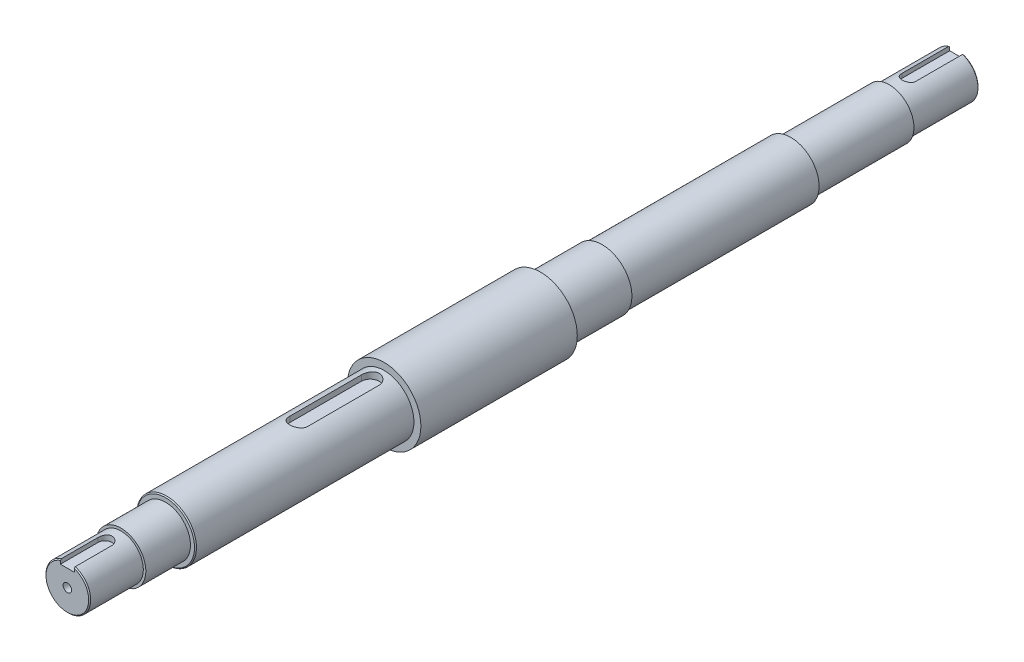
ISO-10303-21;
HEADER;
FILE_DESCRIPTION(('STEP AP214'),'2;1');
FILE_NAME('part.step','',(''),(''),'','','');
FILE_SCHEMA(('AUTOMOTIVE_DESIGN { 1 0 10303 214 1 1 1 1 }'));
ENDSEC;
DATA;
#1=APPLICATION_CONTEXT('core data for automotive mechanical design processes');
#2=APPLICATION_PROTOCOL_DEFINITION('international standard','automotive_design',2000,#1);
#3=PRODUCT_CONTEXT('',#1,'mechanical');
#4=PRODUCT('Part','Part','',(#3));
#5=PRODUCT_RELATED_PRODUCT_CATEGORY('part','',(#4));
#6=PRODUCT_DEFINITION_FORMATION('','',#4);
#7=PRODUCT_DEFINITION_CONTEXT('part definition',#1,'design');
#8=PRODUCT_DEFINITION('design','',#6,#7);
#9=PRODUCT_DEFINITION_SHAPE('','',#8);
#10=(LENGTH_UNIT() NAMED_UNIT(*) SI_UNIT(.MILLI.,.METRE.));
#11=(NAMED_UNIT(*) PLANE_ANGLE_UNIT() SI_UNIT($,.RADIAN.));
#12=(NAMED_UNIT(*) SI_UNIT($,.STERADIAN.) SOLID_ANGLE_UNIT());
#13=UNCERTAINTY_MEASURE_WITH_UNIT(LENGTH_MEASURE(1.E-05),#10,'distance_accuracy_value','');
#14=(GEOMETRIC_REPRESENTATION_CONTEXT(3) GLOBAL_UNCERTAINTY_ASSIGNED_CONTEXT((#13)) GLOBAL_UNIT_ASSIGNED_CONTEXT((#10,
#11,#12)) REPRESENTATION_CONTEXT('',''));
#15=CARTESIAN_POINT('',(0.,0.,0.));
#16=DIRECTION('',(0.,0.,1.));
#17=DIRECTION('',(1.,0.,0.));
#18=AXIS2_PLACEMENT_3D('',#15,#16,#17);
#19=CARTESIAN_POINT('',(0.,17.,-119.));
#20=DIRECTION('',(0.,-1.,0.));
#21=DIRECTION('',(0.,0.,-1.));
#22=AXIS2_PLACEMENT_3D('',#19,#20,#21);
#23=CYLINDRICAL_SURFACE('',#22,7.);
#24=DIRECTION('',(0.,-1.,0.));
#25=VECTOR('',#24,1.);
#26=CARTESIAN_POINT('',(7.,21.3834047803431,-119.));
#27=LINE('',#26,#25);
#28=CARTESIAN_POINT('',(7.,17.,-119.));
#29=VERTEX_POINT('',#28);
#30=CARTESIAN_POINT('',(7.,21.3834047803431,-119.));
#31=VERTEX_POINT('',#30);
#32=EDGE_CURVE('E748',#29,#31,#27,.F.);
#33=ORIENTED_EDGE('',*,*,#32,.F.);
#34=CARTESIAN_POINT('',(0.,17.,-119.));
#35=DIRECTION('',(0.,-1.,0.));
#36=DIRECTION('',(1.,0.,0.));
#37=AXIS2_PLACEMENT_3D('',#34,#35,#36);
#38=CIRCLE('',#37,7.);
#39=CARTESIAN_POINT('',(-7.,17.,-119.));
#40=VERTEX_POINT('',#39);
#41=EDGE_CURVE('E367',#40,#29,#38,.F.);
#42=ORIENTED_EDGE('',*,*,#41,.F.);
#43=DIRECTION('',(0.,-1.,0.));
#44=VECTOR('',#43,1.);
#45=CARTESIAN_POINT('',(-7.,17.,-119.));
#46=LINE('',#45,#44);
#47=CARTESIAN_POINT('',(-7.,21.3834047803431,-119.));
#48=VERTEX_POINT('',#47);
#49=EDGE_CURVE('E749',#48,#40,#46,.T.);
#50=ORIENTED_EDGE('',*,*,#49,.F.);
#51=CARTESIAN_POINT('',(7.,21.3834047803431,-119.));
#52=CARTESIAN_POINT('',(7.00002638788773,21.3833759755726,-118.808252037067));
#53=CARTESIAN_POINT('',(6.99212250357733,21.3859829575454,-118.616514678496));
#54=CARTESIAN_POINT('',(6.96064990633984,21.3962580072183,-118.234510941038));
#55=CARTESIAN_POINT('',(6.93708493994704,21.4039248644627,-118.044244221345));
#56=CARTESIAN_POINT('',(6.87456915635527,21.4240824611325,-117.667041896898));
#57=CARTESIAN_POINT('',(6.83565951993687,21.4365602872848,-117.480098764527));
#58=CARTESIAN_POINT('',(6.74281154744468,21.4659469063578,-117.11033770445));
#59=CARTESIAN_POINT('',(6.68887277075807,21.4828558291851,-116.927519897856));
#60=CARTESIAN_POINT('',(6.56646575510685,21.5205859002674,-116.567371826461));
#61=CARTESIAN_POINT('',(6.49800709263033,21.5414044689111,-116.390038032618));
#62=CARTESIAN_POINT('',(6.34705748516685,21.5863628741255,-116.041810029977));
#63=CARTESIAN_POINT('',(6.26456133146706,21.6105039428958,-115.870918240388));
#64=CARTESIAN_POINT('',(6.08615523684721,21.6614246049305,-115.536677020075));
#65=CARTESIAN_POINT('',(5.99024378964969,21.6882044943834,-115.373328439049));
#66=CARTESIAN_POINT('',(5.78563893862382,21.7436799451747,-115.055107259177));
#67=CARTESIAN_POINT('',(5.67694095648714,21.7723761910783,-114.900237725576));
#68=CARTESIAN_POINT('',(5.44398558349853,21.8318094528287,-114.595350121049));
#69=CARTESIAN_POINT('',(5.31935461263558,21.8625820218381,-114.445624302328));
#70=CARTESIAN_POINT('',(5.05809625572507,21.9244995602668,-114.157114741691));
#71=CARTESIAN_POINT('',(4.92146866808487,21.9556445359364,-114.018331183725));
#72=CARTESIAN_POINT('',(4.63702147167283,22.0174752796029,-113.752530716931));
#73=CARTESIAN_POINT('',(4.48919801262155,22.0481608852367,-113.625517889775));
#74=CARTESIAN_POINT('',(4.18336601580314,22.1082274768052,-113.384184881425));
#75=CARTESIAN_POINT('',(4.02536105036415,22.1376089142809,-113.269860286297));
#76=CARTESIAN_POINT('',(3.69637926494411,22.1949382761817,-113.05217986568));
#77=CARTESIAN_POINT('',(3.5251885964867,22.222838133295,-112.949134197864));
#78=CARTESIAN_POINT('',(3.17432985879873,22.2756613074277,-112.757922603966));
#79=CARTESIAN_POINT('',(2.99466492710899,22.3005857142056,-112.66975122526));
#80=CARTESIAN_POINT('',(2.62804567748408,22.3467560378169,-112.508972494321));
#81=CARTESIAN_POINT('',(2.44109155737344,22.3680020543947,-112.436364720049));
#82=CARTESIAN_POINT('',(2.06124657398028,22.4061975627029,-112.307355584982));
#83=CARTESIAN_POINT('',(1.86835593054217,22.4231472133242,-112.250953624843));
#84=CARTESIAN_POINT('',(1.48406965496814,22.4518043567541,-112.156354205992));
#85=CARTESIAN_POINT('',(1.29280885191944,22.4636563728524,-112.117652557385));
#86=CARTESIAN_POINT('',(0.90749228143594,22.4825189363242,-112.056333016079));
#87=CARTESIAN_POINT('',(0.713436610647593,22.4895296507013,-112.033714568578));
#88=CARTESIAN_POINT('',(0.324029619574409,22.4985094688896,-112.004778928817));
#89=CARTESIAN_POINT('',(0.128678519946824,22.5004794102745,-111.998459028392));
#90=CARTESIAN_POINT('',(-0.261850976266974,22.4993235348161,-112.002174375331));
#91=CARTESIAN_POINT('',(-0.457029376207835,22.4961978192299,-112.012209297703));
#92=CARTESIAN_POINT('',(-0.839016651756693,22.4851350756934,-112.047908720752));
#93=CARTESIAN_POINT('',(-1.02588219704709,22.4773675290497,-112.073022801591));
#94=CARTESIAN_POINT('',(-1.39681014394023,22.4573691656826,-112.138193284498));
#95=CARTESIAN_POINT('',(-1.58087158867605,22.4451368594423,-112.178254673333));
#96=CARTESIAN_POINT('',(-1.94480498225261,22.4165350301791,-112.272959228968));
#97=CARTESIAN_POINT('',(-2.12467830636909,22.4001668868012,-112.327597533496));
#98=CARTESIAN_POINT('',(-2.47918052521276,22.3637078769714,-112.451037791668));
#99=CARTESIAN_POINT('',(-2.65380741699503,22.3436156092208,-112.519845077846));
#100=CARTESIAN_POINT('',(-2.99866751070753,22.2999677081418,-112.671972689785));
#101=CARTESIAN_POINT('',(-3.16882451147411,22.2763739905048,-112.755454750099));
#102=CARTESIAN_POINT('',(-3.50156811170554,22.2265007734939,-112.935773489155));
#103=CARTESIAN_POINT('',(-3.66415208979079,22.2002203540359,-113.032614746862));
#104=CARTESIAN_POINT('',(-3.98072025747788,22.1456467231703,-113.238961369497));
#105=CARTESIAN_POINT('',(-4.13470423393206,22.1173534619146,-113.348467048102));
#106=CARTESIAN_POINT('',(-4.43317367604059,22.0594670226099,-113.579429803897));
#107=CARTESIAN_POINT('',(-4.57765884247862,22.0298738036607,-113.700887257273));
#108=CARTESIAN_POINT('',(-4.86207108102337,21.9688936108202,-113.960275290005));
#109=CARTESIAN_POINT('',(-5.00156109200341,21.9374831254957,-114.098679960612));
#110=CARTESIAN_POINT('',(-5.26840074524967,21.8749338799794,-114.386705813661));
#111=CARTESIAN_POINT('',(-5.39575424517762,21.8437950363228,-114.536323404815));
#112=CARTESIAN_POINT('',(-5.63762072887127,21.7826262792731,-114.845983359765));
#113=CARTESIAN_POINT('',(-5.75212500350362,21.7525971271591,-115.006032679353));
#114=CARTESIAN_POINT('',(-5.96735827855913,21.6945398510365,-115.335396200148));
#115=CARTESIAN_POINT('',(-6.06809264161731,21.6665109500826,-115.504706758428));
#116=CARTESIAN_POINT('',(-6.25621355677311,21.6129469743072,-115.85364568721));
#117=CARTESIAN_POINT('',(-6.34342581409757,21.5874457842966,-116.033373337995));
#118=CARTESIAN_POINT('',(-6.50228494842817,21.5401290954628,-116.39996563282));
#119=CARTESIAN_POINT('',(-6.57393822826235,21.5183120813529,-116.586827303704));
#120=CARTESIAN_POINT('',(-6.70102264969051,21.4790763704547,-116.966217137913));
#121=CARTESIAN_POINT('',(-6.75647102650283,21.4616530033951,-117.158739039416));
#122=CARTESIAN_POINT('',(-6.85070294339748,21.4317592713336,-117.548114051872));
#123=CARTESIAN_POINT('',(-6.88949414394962,21.4192866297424,-117.744965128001));
#124=CARTESIAN_POINT('',(-6.94646198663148,21.4008759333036,-118.118007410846));
#125=CARTESIAN_POINT('',(-6.96653718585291,21.3943385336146,-118.293881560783));
#126=CARTESIAN_POINT('',(-6.99330547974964,21.3855959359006,-118.646499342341));
#127=CARTESIAN_POINT('',(-7.00001756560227,21.3833845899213,-118.823241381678));
#128=CARTESIAN_POINT('',(-7.,21.3834047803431,-119.));
#129=B_SPLINE_CURVE_WITH_KNOTS('',3,(#51,#52,#53,#54,#55,#56,#57,#58,#59,#60,#61,#62,#63,#64,
#65,#66,#67,#68,#69,#70,#71,#72,#73,#74,#75,#76,#77,#78,#79,#80,#81,#82,#83,#84,#85,#86,#87,#88,
#89,#90,#91,#92,#93,#94,#95,#96,#97,#98,#99,#100,#101,#102,#103,#104,#105,#106,#107,#108,#109,
#110,#111,#112,#113,#114,#115,#116,#117,#118,#119,#120,#121,#122,#123,#124,#125,#126,#127,#128),
.UNSPECIFIED.,.F.,.F.,(4,2,2,2,2,2,2,2,2,2,2,2,2,2,2,2,2,2,2,2,2,2,2,2,2,2,2,2,2,2,2,2,2,2,2,2,
2,2,4),(0.,0.575046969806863,1.14995642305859,1.72333336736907,2.29672712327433,
2.86974387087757,3.44297370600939,4.01626795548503,4.58976810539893,5.18076864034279,
5.77177910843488,6.36299375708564,6.95400208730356,7.55850874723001,8.16279332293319,
8.76706151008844,9.37130734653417,9.95706552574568,10.5428034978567,11.1284441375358,
11.7140731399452,12.2795246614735,12.8451649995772,13.4106168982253,13.9762819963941,
14.5486246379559,15.1211639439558,15.6937174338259,16.2662889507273,16.8625896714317,
17.4587002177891,18.055212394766,18.6514915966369,19.2549115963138,19.8580828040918,
20.460610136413,21.0628600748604,21.5937197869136,22.1238245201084),.UNSPECIFIED.);
#130=EDGE_CURVE('E358',#48,#31,#129,.F.);
#131=ORIENTED_EDGE('',*,*,#130,.T.);
#132=EDGE_LOOP('',(#33,#42,#50,#131));
#133=FACE_BOUND('',#132,.T.);
#134=ADVANCED_FACE('F38',(#133),#23,.F.);
#135=CARTESIAN_POINT('',(0.,0.,-99.));
#136=DIRECTION('',(0.,0.,-1.));
#137=DIRECTION('',(-1.,0.,0.));
#138=AXIS2_PLACEMENT_3D('',#135,#136,#137);
#139=PLANE('',#138);
#140=CARTESIAN_POINT('',(0.,0.,-99.));
#141=DIRECTION('',(0.,0.,-1.));
#142=DIRECTION('',(-1.,0.,0.));
#143=AXIS2_PLACEMENT_3D('',#140,#141,#142);
#144=CIRCLE('',#143,25.);
#145=CARTESIAN_POINT('',(-25.,0.,-99.));
#146=VERTEX_POINT('',#145);
#147=EDGE_CURVE('E243',#146,#146,#144,.T.);
#148=ORIENTED_EDGE('',*,*,#147,.T.);
#149=EDGE_LOOP('',(#148));
#150=FACE_BOUND('',#149,.T.);
#151=CARTESIAN_POINT('',(0.,0.,-99.));
#152=DIRECTION('',(0.,0.,-1.));
#153=DIRECTION('',(-1.,0.,0.));
#154=AXIS2_PLACEMENT_3D('',#151,#152,#153);
#155=CIRCLE('',#154,22.5);
#156=CARTESIAN_POINT('',(-22.5,0.,-99.));
#157=VERTEX_POINT('',#156);
#158=EDGE_CURVE('E173',#157,#157,#155,.T.);
#159=ORIENTED_EDGE('',*,*,#158,.F.);
#160=EDGE_LOOP('',(#159));
#161=FACE_BOUND('',#160,.T.);
#162=ADVANCED_FACE('F349',(#150,#161),#139,.T.);
#163=CARTESIAN_POINT('',(0.,0.,252.));
#164=DIRECTION('',(0.,0.,-1.));
#165=DIRECTION('',(-1.,0.,0.));
#166=AXIS2_PLACEMENT_3D('',#163,#164,#165);
#167=CYLINDRICAL_SURFACE('',#166,30.);
#168=CARTESIAN_POINT('',(0.,0.,252.));
#169=DIRECTION('',(0.,0.,1.));
#170=DIRECTION('',(1.,0.,0.));
#171=AXIS2_PLACEMENT_3D('',#168,#169,#170);
#172=CIRCLE('',#171,30.);
#173=CARTESIAN_POINT('',(30.,0.,252.));
#174=VERTEX_POINT('',#173);
#175=EDGE_CURVE('E259',#174,#174,#172,.T.);
#176=ORIENTED_EDGE('',*,*,#175,.F.);
#177=EDGE_LOOP('',(#176));
#178=FACE_BOUND('',#177,.T.);
#179=CARTESIAN_POINT('',(0.,0.,190.));
#180=DIRECTION('',(0.,0.,-1.));
#181=DIRECTION('',(-1.,0.,0.));
#182=AXIS2_PLACEMENT_3D('',#179,#180,#181);
#183=CIRCLE('',#182,30.);
#184=CARTESIAN_POINT('',(-30.,0.,190.));
#185=VERTEX_POINT('',#184);
#186=EDGE_CURVE('E186',#185,#185,#183,.T.);
#187=ORIENTED_EDGE('',*,*,#186,.F.);
#188=EDGE_LOOP('',(#187));
#189=FACE_BOUND('',#188,.T.);
#190=ADVANCED_FACE('F298',(#178,#189),#167,.T.);
#191=CARTESIAN_POINT('',(0.,17.,690.5));
#192=DIRECTION('',(0.,-1.,0.));
#193=DIRECTION('',(0.,0.,-1.));
#194=AXIS2_PLACEMENT_3D('',#191,#192,#193);
#195=CYLINDRICAL_SURFACE('',#194,7.);
#196=DIRECTION('',(0.,-1.,0.));
#197=VECTOR('',#196,1.);
#198=CARTESIAN_POINT('',(-7.,21.3834047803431,690.5));
#199=LINE('',#198,#197);
#200=CARTESIAN_POINT('',(-7.,17.,690.5));
#201=VERTEX_POINT('',#200);
#202=CARTESIAN_POINT('',(-7.,21.3834047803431,690.5));
#203=VERTEX_POINT('',#202);
#204=EDGE_CURVE('E270',#201,#203,#199,.F.);
#205=ORIENTED_EDGE('',*,*,#204,.F.);
#206=CARTESIAN_POINT('',(0.,17.,690.5));
#207=DIRECTION('',(0.,-1.,0.));
#208=DIRECTION('',(0.,0.,-1.));
#209=AXIS2_PLACEMENT_3D('',#206,#207,#208);
#210=CIRCLE('',#209,7.);
#211=CARTESIAN_POINT('',(7.,17.,690.5));
#212=VERTEX_POINT('',#211);
#213=EDGE_CURVE('E276',#212,#201,#210,.F.);
#214=ORIENTED_EDGE('',*,*,#213,.F.);
#215=DIRECTION('',(0.,-1.,0.));
#216=VECTOR('',#215,1.);
#217=CARTESIAN_POINT('',(7.,17.,690.5));
#218=LINE('',#217,#216);
#219=CARTESIAN_POINT('',(7.,21.3834047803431,690.5));
#220=VERTEX_POINT('',#219);
#221=EDGE_CURVE('E273',#220,#212,#218,.T.);
#222=ORIENTED_EDGE('',*,*,#221,.F.);
#223=CARTESIAN_POINT('',(-7.,21.3834047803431,690.5));
#224=CARTESIAN_POINT('',(-7.00002638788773,21.3833759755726,690.308252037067));
#225=CARTESIAN_POINT('',(-6.99212250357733,21.3859829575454,690.116514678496));
#226=CARTESIAN_POINT('',(-6.96064990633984,21.3962580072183,689.734510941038));
#227=CARTESIAN_POINT('',(-6.93708493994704,21.4039248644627,689.544244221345));
#228=CARTESIAN_POINT('',(-6.87456915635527,21.4240824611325,689.167041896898));
#229=CARTESIAN_POINT('',(-6.83565951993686,21.4365602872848,688.980098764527));
#230=CARTESIAN_POINT('',(-6.74281154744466,21.4659469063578,688.610337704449));
#231=CARTESIAN_POINT('',(-6.68887277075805,21.4828558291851,688.427519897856));
#232=CARTESIAN_POINT('',(-6.56646575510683,21.5205859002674,688.067371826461));
#233=CARTESIAN_POINT('',(-6.49800709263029,21.5414044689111,687.890038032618));
#234=CARTESIAN_POINT('',(-6.3470574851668,21.5863628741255,687.541810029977));
#235=CARTESIAN_POINT('',(-6.26456133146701,21.6105039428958,687.370918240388));
#236=CARTESIAN_POINT('',(-6.08615523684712,21.6614246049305,687.036677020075));
#237=CARTESIAN_POINT('',(-5.99024378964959,21.6882044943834,686.873328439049));
#238=CARTESIAN_POINT('',(-5.78563893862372,21.7436799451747,686.555107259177));
#239=CARTESIAN_POINT('',(-5.67694095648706,21.7723761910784,686.400237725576));
#240=CARTESIAN_POINT('',(-5.44398558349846,21.8318094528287,686.095350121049));
#241=CARTESIAN_POINT('',(-5.3193546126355,21.8625820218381,685.945624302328));
#242=CARTESIAN_POINT('',(-5.05809625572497,21.9244995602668,685.657114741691));
#243=CARTESIAN_POINT('',(-4.92146866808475,21.9556445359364,685.518331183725));
#244=CARTESIAN_POINT('',(-4.63702147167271,22.0174752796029,685.252530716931));
#245=CARTESIAN_POINT('',(-4.48919801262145,22.0481608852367,685.125517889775));
#246=CARTESIAN_POINT('',(-4.18336601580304,22.1082274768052,684.884184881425));
#247=CARTESIAN_POINT('',(-4.02536105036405,22.1376089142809,684.769860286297));
#248=CARTESIAN_POINT('',(-3.69637926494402,22.1949382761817,684.55217986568));
#249=CARTESIAN_POINT('',(-3.52518859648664,22.222838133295,684.449134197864));
#250=CARTESIAN_POINT('',(-3.17432985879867,22.2756613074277,684.257922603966));
#251=CARTESIAN_POINT('',(-2.99466492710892,22.3005857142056,684.16975122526));
#252=CARTESIAN_POINT('',(-2.628045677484,22.3467560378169,684.008972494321));
#253=CARTESIAN_POINT('',(-2.44109155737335,22.3680020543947,683.936364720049));
#254=CARTESIAN_POINT('',(-2.06124657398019,22.4061975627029,683.807355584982));
#255=CARTESIAN_POINT('',(-1.86835593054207,22.4231472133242,683.750953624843));
#256=CARTESIAN_POINT('',(-1.48406965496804,22.4518043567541,683.656354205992));
#257=CARTESIAN_POINT('',(-1.29280885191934,22.4636563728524,683.617652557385));
#258=CARTESIAN_POINT('',(-0.907492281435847,22.4825189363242,683.556333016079));
#259=CARTESIAN_POINT('',(-0.713436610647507,22.4895296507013,683.533714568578));
#260=CARTESIAN_POINT('',(-0.324029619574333,22.4985094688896,683.504778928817));
#261=CARTESIAN_POINT('',(-0.128678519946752,22.5004794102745,683.498459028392));
#262=CARTESIAN_POINT('',(0.261850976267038,22.4993235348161,683.502174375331));
#263=CARTESIAN_POINT('',(0.457029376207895,22.4961978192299,683.512209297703));
#264=CARTESIAN_POINT('',(0.839016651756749,22.4851350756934,683.547908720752));
#265=CARTESIAN_POINT('',(1.02588219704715,22.4773675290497,683.573022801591));
#266=CARTESIAN_POINT('',(1.39681014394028,22.4573691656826,683.638193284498));
#267=CARTESIAN_POINT('',(1.5808715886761,22.4451368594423,683.678254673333));
#268=CARTESIAN_POINT('',(1.94480498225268,22.4165350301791,683.772959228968));
#269=CARTESIAN_POINT('',(2.12467830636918,22.4001668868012,683.827597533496));
#270=CARTESIAN_POINT('',(2.47918052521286,22.3637078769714,683.951037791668));
#271=CARTESIAN_POINT('',(2.65380741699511,22.3436156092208,684.019845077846));
#272=CARTESIAN_POINT('',(2.99866751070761,22.2999677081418,684.171972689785));
#273=CARTESIAN_POINT('',(3.16882451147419,22.2763739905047,684.255454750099));
#274=CARTESIAN_POINT('',(3.50156811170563,22.2265007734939,684.435773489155));
#275=CARTESIAN_POINT('',(3.66415208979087,22.2002203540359,684.532614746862));
#276=CARTESIAN_POINT('',(3.98072025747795,22.1456467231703,684.738961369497));
#277=CARTESIAN_POINT('',(4.13470423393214,22.1173534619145,684.848467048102));
#278=CARTESIAN_POINT('',(4.43317367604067,22.0594670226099,685.079429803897));
#279=CARTESIAN_POINT('',(4.57765884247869,22.0298738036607,685.200887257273));
#280=CARTESIAN_POINT('',(4.86207108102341,21.9688936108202,685.460275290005));
#281=CARTESIAN_POINT('',(5.00156109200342,21.9374831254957,685.598679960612));
#282=CARTESIAN_POINT('',(5.26840074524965,21.8749338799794,685.886705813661));
#283=CARTESIAN_POINT('',(5.39575424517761,21.8437950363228,686.036323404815));
#284=CARTESIAN_POINT('',(5.6376207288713,21.7826262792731,686.345983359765));
#285=CARTESIAN_POINT('',(5.75212500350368,21.7525971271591,686.506032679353));
#286=CARTESIAN_POINT('',(5.96735827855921,21.6945398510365,686.835396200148));
#287=CARTESIAN_POINT('',(6.06809264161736,21.6665109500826,687.004706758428));
#288=CARTESIAN_POINT('',(6.25621355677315,21.6129469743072,687.35364568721));
#289=CARTESIAN_POINT('',(6.34342581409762,21.5874457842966,687.533373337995));
#290=CARTESIAN_POINT('',(6.50228494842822,21.5401290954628,687.89996563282));
#291=CARTESIAN_POINT('',(6.57393822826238,21.5183120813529,688.086827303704));
#292=CARTESIAN_POINT('',(6.70102264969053,21.4790763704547,688.466217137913));
#293=CARTESIAN_POINT('',(6.75647102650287,21.4616530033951,688.658739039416));
#294=CARTESIAN_POINT('',(6.85070294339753,21.4317592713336,689.048114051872));
#295=CARTESIAN_POINT('',(6.88949414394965,21.4192866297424,689.244965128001));
#296=CARTESIAN_POINT('',(6.94646198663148,21.4008759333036,689.618007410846));
#297=CARTESIAN_POINT('',(6.96653718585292,21.3943385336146,689.793881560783));
#298=CARTESIAN_POINT('',(6.99330547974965,21.3855959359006,690.146499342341));
#299=CARTESIAN_POINT('',(7.00001756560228,21.3833845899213,690.323241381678));
#300=CARTESIAN_POINT('',(7.,21.3834047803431,690.5));
#301=B_SPLINE_CURVE_WITH_KNOTS('',3,(#223,#224,#225,#226,#227,#228,#229,#230,#231,#232,#233,
#234,#235,#236,#237,#238,#239,#240,#241,#242,#243,#244,#245,#246,#247,#248,#249,#250,#251,#252,
#253,#254,#255,#256,#257,#258,#259,#260,#261,#262,#263,#264,#265,#266,#267,#268,#269,#270,#271,
#272,#273,#274,#275,#276,#277,#278,#279,#280,#281,#282,#283,#284,#285,#286,#287,#288,#289,#290,
#291,#292,#293,#294,#295,#296,#297,#298,#299,#300),.UNSPECIFIED.,.F.,.F.,(4,2,2,2,2,2,2,2,2,2,2,
2,2,2,2,2,2,2,2,2,2,2,2,2,2,2,2,2,2,2,2,2,2,2,2,2,2,2,4),(0.,0.575046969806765,1.14995642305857,
1.7233333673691,2.29672712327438,2.86974387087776,3.44297370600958,4.01626795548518,
4.5897681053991,5.18076864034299,5.77177910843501,6.36299375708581,6.95400208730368,
7.55850874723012,8.16279332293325,8.76706151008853,9.37130734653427,9.95706552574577,
10.5428034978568,11.1284441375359,11.7140731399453,12.2795246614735,12.8451649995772,
13.4106168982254,13.9762819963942,14.548624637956,15.1211639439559,15.693717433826,
16.2662889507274,16.8625896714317,17.4587002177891,18.0552123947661,18.6514915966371,
19.2549115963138,19.858082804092,20.4606101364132,21.0628600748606,21.5937197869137,
22.1238245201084),.UNSPECIFIED.);
#302=EDGE_CURVE('E278',#220,#203,#301,.F.);
#303=ORIENTED_EDGE('',*,*,#302,.T.);
#304=EDGE_LOOP('',(#205,#214,#222,#303));
#305=FACE_BOUND('',#304,.T.);
#306=ADVANCED_FACE('F292',(#305),#195,.F.);
#307=CARTESIAN_POINT('',(0.,0.,674.5));
#308=DIRECTION('',(0.,0.,1.));
#309=DIRECTION('',(1.,0.,0.));
#310=AXIS2_PLACEMENT_3D('',#307,#308,#309);
#311=PLANE('',#310);
#312=CARTESIAN_POINT('',(0.,0.,674.5));
#313=DIRECTION('',(0.,0.,1.));
#314=DIRECTION('',(1.,0.,0.));
#315=AXIS2_PLACEMENT_3D('',#312,#313,#314);
#316=CIRCLE('',#315,25.);
#317=CARTESIAN_POINT('',(-25.,0.,674.5));
#318=VERTEX_POINT('',#317);
#319=EDGE_CURVE('E247',#318,#318,#316,.T.);
#320=ORIENTED_EDGE('',*,*,#319,.T.);
#321=EDGE_LOOP('',(#320));
#322=FACE_BOUND('',#321,.T.);
#323=CARTESIAN_POINT('',(0.,0.,674.5));
#324=DIRECTION('',(0.,0.,1.));
#325=DIRECTION('',(1.,0.,0.));
#326=AXIS2_PLACEMENT_3D('',#323,#324,#325);
#327=CIRCLE('',#326,22.5);
#328=CARTESIAN_POINT('',(22.5,0.,674.5));
#329=VERTEX_POINT('',#328);
#330=EDGE_CURVE('E233',#329,#329,#327,.T.);
#331=ORIENTED_EDGE('',*,*,#330,.F.);
#332=EDGE_LOOP('',(#331));
#333=FACE_BOUND('',#332,.T.);
#334=ADVANCED_FACE('F297',(#322,#333),#311,.T.);
#335=CARTESIAN_POINT('',(0.,0.,629.5));
#336=DIRECTION('',(0.,0.,1.));
#337=DIRECTION('',(1.,0.,0.));
#338=AXIS2_PLACEMENT_3D('',#335,#336,#337);
#339=PLANE('',#338);
#340=CARTESIAN_POINT('',(0.,0.,629.5));
#341=DIRECTION('',(0.,0.,1.));
#342=DIRECTION('',(1.,0.,0.));
#343=AXIS2_PLACEMENT_3D('',#340,#341,#342);
#344=CIRCLE('',#343,29.);
#345=CARTESIAN_POINT('',(29.,0.,629.5));
#346=VERTEX_POINT('',#345);
#347=EDGE_CURVE('E325',#346,#346,#344,.T.);
#348=ORIENTED_EDGE('',*,*,#347,.T.);
#349=EDGE_LOOP('',(#348));
#350=FACE_BOUND('',#349,.T.);
#351=CARTESIAN_POINT('',(0.,0.,629.5));
#352=DIRECTION('',(0.,0.,1.));
#353=DIRECTION('',(1.,0.,0.));
#354=AXIS2_PLACEMENT_3D('',#351,#352,#353);
#355=CIRCLE('',#354,25.);
#356=CARTESIAN_POINT('',(-25.,0.,629.5));
#357=VERTEX_POINT('',#356);
#358=EDGE_CURVE('E246',#357,#357,#355,.T.);
#359=ORIENTED_EDGE('',*,*,#358,.F.);
#360=EDGE_LOOP('',(#359));
#361=FACE_BOUND('',#360,.T.);
#362=ADVANCED_FACE('F425',(#350,#361),#339,.T.);
#363=CARTESIAN_POINT('',(0.,0.,409.5));
#364=DIRECTION('',(0.,0.,1.));
#365=DIRECTION('',(1.,0.,0.));
#366=AXIS2_PLACEMENT_3D('',#363,#364,#365);
#367=PLANE('',#366);
#368=CARTESIAN_POINT('',(0.,0.,409.5));
#369=DIRECTION('',(0.,0.,1.));
#370=DIRECTION('',(1.,0.,0.));
#371=AXIS2_PLACEMENT_3D('',#368,#369,#370);
#372=CIRCLE('',#371,37.);
#373=CARTESIAN_POINT('',(37.,0.,409.5));
#374=VERTEX_POINT('',#373);
#375=EDGE_CURVE('E256',#374,#374,#372,.T.);
#376=ORIENTED_EDGE('',*,*,#375,.T.);
#377=EDGE_LOOP('',(#376));
#378=FACE_BOUND('',#377,.T.);
#379=CARTESIAN_POINT('',(0.,0.,409.5));
#380=DIRECTION('',(0.,0.,1.));
#381=DIRECTION('',(1.,0.,0.));
#382=AXIS2_PLACEMENT_3D('',#379,#380,#381);
#383=CIRCLE('',#382,30.);
#384=CARTESIAN_POINT('',(30.,0.,409.5));
#385=VERTEX_POINT('',#384);
#386=EDGE_CURVE('E250',#385,#385,#383,.T.);
#387=ORIENTED_EDGE('',*,*,#386,.F.);
#388=EDGE_LOOP('',(#387));
#389=FACE_BOUND('',#388,.T.);
#390=ADVANCED_FACE('F427',(#378,#389),#367,.T.);
#391=CARTESIAN_POINT('',(0.,0.,252.));
#392=DIRECTION('',(0.,0.,1.));
#393=DIRECTION('',(1.,0.,0.));
#394=AXIS2_PLACEMENT_3D('',#391,#392,#393);
#395=PLANE('',#394);
#396=CARTESIAN_POINT('',(0.,0.,252.));
#397=DIRECTION('',(0.,0.,1.));
#398=DIRECTION('',(1.,0.,0.));
#399=AXIS2_PLACEMENT_3D('',#396,#397,#398);
#400=CIRCLE('',#399,37.);
#401=CARTESIAN_POINT('',(37.,0.,252.));
#402=VERTEX_POINT('',#401);
#403=EDGE_CURVE('E255',#402,#402,#400,.T.);
#404=ORIENTED_EDGE('',*,*,#403,.F.);
#405=EDGE_LOOP('',(#404));
#406=FACE_BOUND('',#405,.T.);
#407=ORIENTED_EDGE('',*,*,#175,.T.);
#408=EDGE_LOOP('',(#407));
#409=FACE_BOUND('',#408,.T.);
#410=ADVANCED_FACE('F431',(#406,#409),#395,.F.);
#411=CARTESIAN_POINT('',(0.,0.,409.5));
#412=DIRECTION('',(0.,0.,-1.));
#413=DIRECTION('',(-1.,0.,0.));
#414=AXIS2_PLACEMENT_3D('',#411,#412,#413);
#415=CYLINDRICAL_SURFACE('',#414,37.);
#416=ORIENTED_EDGE('',*,*,#375,.F.);
#417=EDGE_LOOP('',(#416));
#418=FACE_BOUND('',#417,.T.);
#419=ORIENTED_EDGE('',*,*,#403,.T.);
#420=EDGE_LOOP('',(#419));
#421=FACE_BOUND('',#420,.T.);
#422=ADVANCED_FACE('F423',(#418,#421),#415,.T.);
#423=CARTESIAN_POINT('',(0.,0.,629.5));
#424=DIRECTION('',(0.,0.,-1.));
#425=DIRECTION('',(-1.,0.,0.));
#426=AXIS2_PLACEMENT_3D('',#423,#424,#425);
#427=CYLINDRICAL_SURFACE('',#426,30.);
#428=DIRECTION('',(0.,0.,-1.));
#429=VECTOR('',#428,1.);
#430=CARTESIAN_POINT('',(8.99999999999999,28.6181760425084,629.5));
#431=LINE('',#430,#429);
#432=CARTESIAN_POINT('',(8.99999999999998,28.6181760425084,423.5));
#433=VERTEX_POINT('',#432);
#434=CARTESIAN_POINT('',(8.99999999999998,28.6181760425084,495.5));
#435=VERTEX_POINT('',#434);
#436=EDGE_CURVE('E750',#433,#435,#431,.F.);
#437=ORIENTED_EDGE('',*,*,#436,.T.);
#438=CARTESIAN_POINT('',(8.99999999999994,28.6181760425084,495.5));
#439=CARTESIAN_POINT('',(9.00003345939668,28.6181405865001,495.747001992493));
#440=CARTESIAN_POINT('',(8.98983319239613,28.621372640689,495.99399108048));
#441=CARTESIAN_POINT('',(8.94921297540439,28.634112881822,496.486084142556));
#442=CARTESIAN_POINT('',(8.91879757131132,28.6436196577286,496.731188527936));
#443=CARTESIAN_POINT('',(8.8380968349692,28.6686190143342,497.217150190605));
#444=CARTESIAN_POINT('',(8.78786195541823,28.6840963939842,497.458016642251));
#445=CARTESIAN_POINT('',(8.66797644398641,28.7205524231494,497.934443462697));
#446=CARTESIAN_POINT('',(8.59832530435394,28.7415312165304,498.17000369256));
#447=CARTESIAN_POINT('',(8.4402392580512,28.788350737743,498.63407398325));
#448=CARTESIAN_POINT('',(8.35181542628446,28.8141885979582,498.862588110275));
#449=CARTESIAN_POINT('',(8.15682366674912,28.8699932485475,499.311311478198));
#450=CARTESIAN_POINT('',(8.05024901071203,28.8999615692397,499.531517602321));
#451=CARTESIAN_POINT('',(7.81973996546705,28.9631825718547,499.962212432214));
#452=CARTESIAN_POINT('',(7.6958017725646,28.9964359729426,500.172698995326));
#453=CARTESIAN_POINT('',(7.43143303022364,29.0653136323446,500.582646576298));
#454=CARTESIAN_POINT('',(7.29100159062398,29.1009380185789,500.78210699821));
#455=CARTESIAN_POINT('',(6.99033485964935,29.1746438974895,501.174328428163));
#456=CARTESIAN_POINT('',(6.8296494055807,29.2127664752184,501.366736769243));
#457=CARTESIAN_POINT('',(6.49284654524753,29.2894651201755,501.73744026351));
#458=CARTESIAN_POINT('',(6.31672889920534,29.3280411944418,501.915735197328));
#459=CARTESIAN_POINT('',(5.95013898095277,29.4046069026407,502.257113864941));
#460=CARTESIAN_POINT('',(5.75966408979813,29.4425964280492,502.420194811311));
#461=CARTESIAN_POINT('',(5.36558117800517,29.5169568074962,502.730031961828));
#462=CARTESIAN_POINT('',(5.16197353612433,29.5533277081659,502.876788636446));
#463=CARTESIAN_POINT('',(4.73849718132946,29.6242077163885,503.155866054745));
#464=CARTESIAN_POINT('',(4.51837706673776,29.658661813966,503.287819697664));
#465=CARTESIAN_POINT('',(4.06733115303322,29.7238744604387,503.532597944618));
#466=CARTESIAN_POINT('',(3.83640960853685,29.7546344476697,503.645430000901));
#467=CARTESIAN_POINT('',(3.36528194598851,29.8115945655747,503.85110414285));
#468=CARTESIAN_POINT('',(3.12507587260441,29.8377947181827,503.943946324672));
#469=CARTESIAN_POINT('',(2.63712035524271,29.8848734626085,504.108827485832));
#470=CARTESIAN_POINT('',(2.38937116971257,29.9057522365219,504.180867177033));
#471=CARTESIAN_POINT('',(1.89536420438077,29.941061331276,504.301726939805));
#472=CARTESIAN_POINT('',(1.64926633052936,29.9556589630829,504.35115203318));
#473=CARTESIAN_POINT('',(1.15352379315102,29.9788416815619,504.429296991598));
#474=CARTESIAN_POINT('',(0.903879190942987,29.9874268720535,504.458017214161));
#475=CARTESIAN_POINT('',(0.402966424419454,29.9983393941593,504.494479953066));
#476=CARTESIAN_POINT('',(0.151698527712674,30.0006677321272,504.502225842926));
#477=CARTESIAN_POINT('',(-0.350581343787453,29.999002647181,504.496675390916));
#478=CARTESIAN_POINT('',(-0.601593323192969,29.995009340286,504.48337943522));
#479=CARTESIAN_POINT('',(-1.09342288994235,29.981044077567,504.436636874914));
#480=CARTESIAN_POINT('',(-1.33430914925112,29.9712680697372,504.403850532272));
#481=CARTESIAN_POINT('',(-1.8124463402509,29.9461578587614,504.318957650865));
#482=CARTESIAN_POINT('',(-2.04969594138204,29.9308216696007,504.266844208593));
#483=CARTESIAN_POINT('',(-2.5188006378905,29.8949991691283,504.143751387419));
#484=CARTESIAN_POINT('',(-2.75065669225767,29.8745137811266,504.072775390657));
#485=CARTESIAN_POINT('',(-3.20749457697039,29.828923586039,503.912525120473));
#486=CARTESIAN_POINT('',(-3.43247608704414,29.8038185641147,503.823249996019));
#487=CARTESIAN_POINT('',(-3.87668806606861,29.7493184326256,503.625948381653));
#488=CARTESIAN_POINT('',(-4.09582147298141,29.719876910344,503.517716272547));
#489=CARTESIAN_POINT('',(-4.52421097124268,29.6576865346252,503.284025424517));
#490=CARTESIAN_POINT('',(-4.73346680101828,29.6249375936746,503.158566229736));
#491=CARTESIAN_POINT('',(-5.14083485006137,29.5569698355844,502.8912898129));
#492=CARTESIAN_POINT('',(-5.33894686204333,29.5217509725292,502.749472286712));
#493=CARTESIAN_POINT('',(-5.72291425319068,29.4497271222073,502.450359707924));
#494=CARTESIAN_POINT('',(-5.90876553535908,29.4129216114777,502.293059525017));
#495=CARTESIAN_POINT('',(-6.27392393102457,29.3372454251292,501.957682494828));
#496=CARTESIAN_POINT('',(-6.45270703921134,29.2983496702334,501.779040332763));
#497=CARTESIAN_POINT('',(-6.79466140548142,29.2209397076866,501.407313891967));
#498=CARTESIAN_POINT('',(-6.95783250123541,29.1824255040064,501.214229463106));
#499=CARTESIAN_POINT('',(-7.26756046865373,29.1068376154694,500.814741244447));
#500=CARTESIAN_POINT('',(-7.4141091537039,29.069764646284,500.608330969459));
#501=CARTESIAN_POINT('',(-7.68942708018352,28.9981541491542,500.183665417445));
#502=CARTESIAN_POINT('',(-7.81820290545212,28.9636156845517,499.965414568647));
#503=CARTESIAN_POINT('',(-8.05834620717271,28.8977288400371,499.51604729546));
#504=CARTESIAN_POINT('',(-8.16951557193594,28.8664179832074,499.28481938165));
#505=CARTESIAN_POINT('',(-8.37184037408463,28.8083905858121,498.813317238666));
#506=CARTESIAN_POINT('',(-8.46300399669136,28.7816721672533,498.573046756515));
#507=CARTESIAN_POINT('',(-8.62449218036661,28.7336951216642,498.085351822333));
#508=CARTESIAN_POINT('',(-8.6948386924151,28.7124307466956,497.837935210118));
#509=CARTESIAN_POINT('',(-8.814141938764,28.6760314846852,497.337660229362));
#510=CARTESIAN_POINT('',(-8.86310853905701,28.6608937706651,497.084804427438));
#511=CARTESIAN_POINT('',(-8.93404697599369,28.6388555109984,496.610094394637));
#512=CARTESIAN_POINT('',(-8.95877956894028,28.6311161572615,496.388687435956));
#513=CARTESIAN_POINT('',(-8.99175392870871,28.6207689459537,495.944859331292));
#514=CARTESIAN_POINT('',(-9.00001994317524,28.6181535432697,495.722440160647));
#515=CARTESIAN_POINT('',(-9.00000000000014,28.6181760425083,495.5));
#516=B_SPLINE_CURVE_WITH_KNOTS('',3,(#438,#439,#440,#441,#442,#443,#444,#445,#446,#447,#448,
#449,#450,#451,#452,#453,#454,#455,#456,#457,#458,#459,#460,#461,#462,#463,#464,#465,#466,#467,
#468,#469,#470,#471,#472,#473,#474,#475,#476,#477,#478,#479,#480,#481,#482,#483,#484,#485,#486,
#487,#488,#489,#490,#491,#492,#493,#494,#495,#496,#497,#498,#499,#500,#501,#502,#503,#504,#505,
#506,#507,#508,#509,#510,#511,#512,#513,#514,#515),.UNSPECIFIED.,.F.,.F.,(4,2,2,2,2,2,2,2,2,2,2,
2,2,2,2,2,2,2,2,2,2,2,2,2,2,2,2,2,2,2,2,2,2,2,2,2,2,2,4),(0.,0.740754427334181,1.48134233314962,
2.22005702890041,2.95879104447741,3.69709045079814,4.43566413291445,5.17439986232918,
5.91317548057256,6.67299483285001,7.4328259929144,8.19279609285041,8.95274428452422,
9.72862284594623,10.5041983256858,11.2797700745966,12.0553152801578,12.8086853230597,
13.5620423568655,14.315278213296,15.0685002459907,15.7975536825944,16.5268677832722,
17.2560512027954,17.9852685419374,18.7229498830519,19.460650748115,20.1983653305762,
20.9363251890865,21.7025751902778,22.4688331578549,23.2354668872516,24.0018158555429,
24.7762543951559,25.550375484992,26.3236773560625,27.0966220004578,27.764719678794,
28.4318328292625),.UNSPECIFIED.);
#517=CARTESIAN_POINT('',(-9.00000000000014,28.6181760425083,495.5));
#518=VERTEX_POINT('',#517);
#519=EDGE_CURVE('E403',#435,#518,#516,.T.);
#520=ORIENTED_EDGE('',*,*,#519,.T.);
#521=DIRECTION('',(0.,0.,-1.));
#522=VECTOR('',#521,1.);
#523=CARTESIAN_POINT('',(-9.00000000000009,28.6181760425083,629.5));
#524=LINE('',#523,#522);
#525=CARTESIAN_POINT('',(-9.00000000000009,28.6181760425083,423.5));
#526=VERTEX_POINT('',#525);
#527=EDGE_CURVE('E757',#518,#526,#524,.T.);
#528=ORIENTED_EDGE('',*,*,#527,.T.);
#529=CARTESIAN_POINT('',(-9.00000000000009,28.6181760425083,423.5));
#530=CARTESIAN_POINT('',(-9.00003345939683,28.6181405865,423.252998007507));
#531=CARTESIAN_POINT('',(-8.98983319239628,28.621372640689,423.00600891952));
#532=CARTESIAN_POINT('',(-8.94921297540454,28.6341128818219,422.513915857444));
#533=CARTESIAN_POINT('',(-8.91879757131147,28.6436196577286,422.268811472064));
#534=CARTESIAN_POINT('',(-8.83809683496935,28.6686190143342,421.782849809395));
#535=CARTESIAN_POINT('',(-8.78786195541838,28.6840963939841,421.541983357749));
#536=CARTESIAN_POINT('',(-8.66797644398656,28.7205524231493,421.065556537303));
#537=CARTESIAN_POINT('',(-8.5983253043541,28.7415312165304,420.82999630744));
#538=CARTESIAN_POINT('',(-8.44023925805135,28.7883507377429,420.36592601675));
#539=CARTESIAN_POINT('',(-8.35181542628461,28.8141885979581,420.137411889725));
#540=CARTESIAN_POINT('',(-8.15682366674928,28.8699932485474,419.688688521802));
#541=CARTESIAN_POINT('',(-8.0502490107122,28.8999615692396,419.468482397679));
#542=CARTESIAN_POINT('',(-7.81973996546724,28.9631825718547,419.037787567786));
#543=CARTESIAN_POINT('',(-7.69580177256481,28.9964359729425,418.827301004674));
#544=CARTESIAN_POINT('',(-7.43143303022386,29.0653136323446,418.417353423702));
#545=CARTESIAN_POINT('',(-7.2910015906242,29.1009380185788,418.21789300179));
#546=CARTESIAN_POINT('',(-6.9903348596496,29.1746438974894,417.825671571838));
#547=CARTESIAN_POINT('',(-6.82964940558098,29.2127664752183,417.633263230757));
#548=CARTESIAN_POINT('',(-6.49284654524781,29.2894651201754,417.26255973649));
#549=CARTESIAN_POINT('',(-6.31672889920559,29.3280411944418,417.084264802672));
#550=CARTESIAN_POINT('',(-5.95013898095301,29.4046069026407,416.742886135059));
#551=CARTESIAN_POINT('',(-5.75966408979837,29.4425964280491,416.579805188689));
#552=CARTESIAN_POINT('',(-5.36558117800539,29.5169568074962,416.269968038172));
#553=CARTESIAN_POINT('',(-5.1619735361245,29.5533277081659,416.123211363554));
#554=CARTESIAN_POINT('',(-4.73849718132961,29.6242077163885,415.844133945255));
#555=CARTESIAN_POINT('',(-4.51837706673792,29.658661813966,415.712180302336));
#556=CARTESIAN_POINT('',(-4.06733115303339,29.7238744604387,415.467402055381));
#557=CARTESIAN_POINT('',(-3.83640960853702,29.7546344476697,415.354569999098));
#558=CARTESIAN_POINT('',(-3.36528194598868,29.8115945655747,415.14889585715));
#559=CARTESIAN_POINT('',(-3.12507587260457,29.8377947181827,415.056053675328));
#560=CARTESIAN_POINT('',(-2.63712035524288,29.8848734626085,414.891172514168));
#561=CARTESIAN_POINT('',(-2.38937116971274,29.9057522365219,414.819132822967));
#562=CARTESIAN_POINT('',(-1.89536420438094,29.941061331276,414.698273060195));
#563=CARTESIAN_POINT('',(-1.64926633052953,29.9556589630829,414.64884796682));
#564=CARTESIAN_POINT('',(-1.15352379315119,29.9788416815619,414.570703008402));
#565=CARTESIAN_POINT('',(-0.903879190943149,29.9874268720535,414.541982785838));
#566=CARTESIAN_POINT('',(-0.402966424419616,29.9983393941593,414.505520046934));
#567=CARTESIAN_POINT('',(-0.151698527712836,30.0006677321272,414.497774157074));
#568=CARTESIAN_POINT('',(0.350581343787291,29.999002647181,414.503324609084));
#569=CARTESIAN_POINT('',(0.601593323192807,29.995009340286,414.51662056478));
#570=CARTESIAN_POINT('',(1.09342288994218,29.981044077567,414.563363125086));
#571=CARTESIAN_POINT('',(1.33430914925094,29.9712680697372,414.596149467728));
#572=CARTESIAN_POINT('',(1.81244634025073,29.9461578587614,414.681042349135));
#573=CARTESIAN_POINT('',(2.04969594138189,29.9308216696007,414.733155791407));
#574=CARTESIAN_POINT('',(2.51880063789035,29.8949991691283,414.856248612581));
#575=CARTESIAN_POINT('',(2.7506566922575,29.8745137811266,414.927224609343));
#576=CARTESIAN_POINT('',(3.20749457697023,29.828923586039,415.087474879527));
#577=CARTESIAN_POINT('',(3.43247608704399,29.8038185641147,415.176750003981));
#578=CARTESIAN_POINT('',(3.87668806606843,29.7493184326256,415.374051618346));
#579=CARTESIAN_POINT('',(4.09582147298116,29.719876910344,415.482283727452));
#580=CARTESIAN_POINT('',(4.52421097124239,29.6576865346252,415.715974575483));
#581=CARTESIAN_POINT('',(4.73346680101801,29.6249375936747,415.841433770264));
#582=CARTESIAN_POINT('',(5.14083485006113,29.5569698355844,416.1087101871));
#583=CARTESIAN_POINT('',(5.33894686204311,29.5217509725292,416.250527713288));
#584=CARTESIAN_POINT('',(5.72291425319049,29.4497271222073,416.549640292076));
#585=CARTESIAN_POINT('',(5.90876553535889,29.4129216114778,416.706940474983));
#586=CARTESIAN_POINT('',(6.27392393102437,29.3372454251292,417.042317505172));
#587=CARTESIAN_POINT('',(6.45270703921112,29.2983496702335,417.220959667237));
#588=CARTESIAN_POINT('',(6.7946614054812,29.2209397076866,417.592686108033));
#589=CARTESIAN_POINT('',(6.95783250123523,29.1824255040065,417.785770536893));
#590=CARTESIAN_POINT('',(7.26756046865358,29.1068376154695,418.185258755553));
#591=CARTESIAN_POINT('',(7.41410915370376,29.069764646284,418.391669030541));
#592=CARTESIAN_POINT('',(7.68942708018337,28.9981541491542,418.816334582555));
#593=CARTESIAN_POINT('',(7.81820290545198,28.9636156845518,419.034585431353));
#594=CARTESIAN_POINT('',(8.05834620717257,28.8977288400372,419.48395270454));
#595=CARTESIAN_POINT('',(8.16951557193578,28.8664179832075,419.71518061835));
#596=CARTESIAN_POINT('',(8.37184037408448,28.8083905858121,420.186682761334));
#597=CARTESIAN_POINT('',(8.4630039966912,28.7816721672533,420.426953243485));
#598=CARTESIAN_POINT('',(8.62449218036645,28.7336951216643,420.914648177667));
#599=CARTESIAN_POINT('',(8.69483869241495,28.7124307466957,421.162064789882));
#600=CARTESIAN_POINT('',(8.81414193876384,28.6760314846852,421.662339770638));
#601=CARTESIAN_POINT('',(8.86310853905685,28.6608937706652,421.915195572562));
#602=CARTESIAN_POINT('',(8.93404697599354,28.6388555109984,422.389905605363));
#603=CARTESIAN_POINT('',(8.95877956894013,28.6311161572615,422.611312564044));
#604=CARTESIAN_POINT('',(8.99175392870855,28.6207689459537,423.055140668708));
#605=CARTESIAN_POINT('',(9.00001994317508,28.6181535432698,423.277559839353));
#606=CARTESIAN_POINT('',(8.99999999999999,28.6181760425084,423.5));
#607=B_SPLINE_CURVE_WITH_KNOTS('',3,(#529,#530,#531,#532,#533,#534,#535,#536,#537,#538,#539,
#540,#541,#542,#543,#544,#545,#546,#547,#548,#549,#550,#551,#552,#553,#554,#555,#556,#557,#558,
#559,#560,#561,#562,#563,#564,#565,#566,#567,#568,#569,#570,#571,#572,#573,#574,#575,#576,#577,
#578,#579,#580,#581,#582,#583,#584,#585,#586,#587,#588,#589,#590,#591,#592,#593,#594,#595,#596,
#597,#598,#599,#600,#601,#602,#603,#604,#605,#606),.UNSPECIFIED.,.F.,.F.,(4,2,2,2,2,2,2,2,2,2,2,
2,2,2,2,2,2,2,2,2,2,2,2,2,2,2,2,2,2,2,2,2,2,2,2,2,2,2,4),(0.,0.740754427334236,1.48134233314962,
2.22005702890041,2.95879104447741,3.69709045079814,4.43566413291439,5.174399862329,
5.91317548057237,6.67299483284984,7.43282599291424,8.19279609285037,8.95274428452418,
9.72862284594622,10.5041983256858,11.2797700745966,12.0553152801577,12.8086853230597,
13.5620423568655,14.315278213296,15.0685002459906,15.7975536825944,16.5268677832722,
17.2560512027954,17.9852685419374,18.7229498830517,19.4606507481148,20.1983653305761,
20.9363251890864,21.7025751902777,22.4688331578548,23.2354668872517,24.0018158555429,
24.7762543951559,25.550375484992,26.3236773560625,27.0966220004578,27.764719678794,
28.4318328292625),.UNSPECIFIED.);
#608=EDGE_CURVE('E411',#526,#433,#607,.T.);
#609=ORIENTED_EDGE('',*,*,#608,.T.);
#610=EDGE_LOOP('',(#437,#520,#528,#609));
#611=FACE_BOUND('',#610,.T.);
#612=CARTESIAN_POINT('',(0.,0.,628.5));
#613=DIRECTION('',(0.,0.,1.));
#614=DIRECTION('',(1.,0.,0.));
#615=AXIS2_PLACEMENT_3D('',#612,#613,#614);
#616=CIRCLE('',#615,30.);
#617=CARTESIAN_POINT('',(30.,0.,628.5));
#618=VERTEX_POINT('',#617);
#619=EDGE_CURVE('E412',#618,#618,#616,.F.);
#620=ORIENTED_EDGE('',*,*,#619,.T.);
#621=EDGE_LOOP('',(#620));
#622=FACE_BOUND('',#621,.T.);
#623=ORIENTED_EDGE('',*,*,#386,.T.);
#624=EDGE_LOOP('',(#623));
#625=FACE_BOUND('',#624,.T.);
#626=ADVANCED_FACE('F418',(#611,#622,#625),#427,.T.);
#627=CARTESIAN_POINT('',(0.,0.,674.5));
#628=DIRECTION('',(0.,0.,-1.));
#629=DIRECTION('',(-1.,0.,0.));
#630=AXIS2_PLACEMENT_3D('',#627,#628,#629);
#631=CYLINDRICAL_SURFACE('',#630,25.);
#632=CARTESIAN_POINT('',(-25.,0.,674.5));
#633=CARTESIAN_POINT('',(-25.,0.,674.03125));
#634=CARTESIAN_POINT('',(-25.,0.,673.5625));
#635=CARTESIAN_POINT('',(-25.,0.,672.625));
#636=CARTESIAN_POINT('',(-25.,0.,672.15625));
#637=CARTESIAN_POINT('',(-25.,0.,671.21875));
#638=CARTESIAN_POINT('',(-25.,0.,670.75));
#639=CARTESIAN_POINT('',(-25.,0.,669.8125));
#640=CARTESIAN_POINT('',(-25.,0.,669.34375));
#641=CARTESIAN_POINT('',(-25.,0.,668.40625));
#642=CARTESIAN_POINT('',(-25.,0.,667.9375));
#643=CARTESIAN_POINT('',(-25.,0.,667.));
#644=CARTESIAN_POINT('',(-25.,0.,666.53125));
#645=CARTESIAN_POINT('',(-25.,0.,665.59375));
#646=CARTESIAN_POINT('',(-25.,0.,665.125));
#647=CARTESIAN_POINT('',(-25.,0.,664.1875));
#648=CARTESIAN_POINT('',(-25.,0.,663.71875));
#649=CARTESIAN_POINT('',(-25.,0.,662.78125));
#650=CARTESIAN_POINT('',(-25.,0.,662.3125));
#651=CARTESIAN_POINT('',(-25.,0.,661.375));
#652=CARTESIAN_POINT('',(-25.,0.,660.90625));
#653=CARTESIAN_POINT('',(-25.,0.,659.96875));
#654=CARTESIAN_POINT('',(-25.,0.,659.5));
#655=CARTESIAN_POINT('',(-25.,0.,658.5625));
#656=CARTESIAN_POINT('',(-25.,0.,658.09375));
#657=CARTESIAN_POINT('',(-25.,0.,657.15625));
#658=CARTESIAN_POINT('',(-25.,0.,656.6875));
#659=CARTESIAN_POINT('',(-25.,0.,655.75));
#660=CARTESIAN_POINT('',(-25.,0.,655.28125));
#661=CARTESIAN_POINT('',(-25.,0.,654.34375));
#662=CARTESIAN_POINT('',(-25.,0.,653.875));
#663=CARTESIAN_POINT('',(-25.,0.,652.9375));
#664=CARTESIAN_POINT('',(-25.,0.,652.46875));
#665=CARTESIAN_POINT('',(-25.,0.,651.53125));
#666=CARTESIAN_POINT('',(-25.,0.,651.0625));
#667=CARTESIAN_POINT('',(-25.,0.,650.125));
#668=CARTESIAN_POINT('',(-25.,0.,649.65625));
#669=CARTESIAN_POINT('',(-25.,0.,648.71875));
#670=CARTESIAN_POINT('',(-25.,0.,648.25));
#671=CARTESIAN_POINT('',(-25.,0.,647.3125));
#672=CARTESIAN_POINT('',(-25.,0.,646.84375));
#673=CARTESIAN_POINT('',(-25.,0.,645.90625));
#674=CARTESIAN_POINT('',(-25.,0.,645.4375));
#675=CARTESIAN_POINT('',(-25.,0.,644.5));
#676=CARTESIAN_POINT('',(-25.,0.,644.03125));
#677=CARTESIAN_POINT('',(-25.,0.,643.09375));
#678=CARTESIAN_POINT('',(-25.,0.,642.625));
#679=CARTESIAN_POINT('',(-25.,0.,641.6875));
#680=CARTESIAN_POINT('',(-25.,0.,641.21875));
#681=CARTESIAN_POINT('',(-25.,0.,640.28125));
#682=CARTESIAN_POINT('',(-25.,0.,639.8125));
#683=CARTESIAN_POINT('',(-25.,0.,638.875));
#684=CARTESIAN_POINT('',(-25.,0.,638.40625));
#685=CARTESIAN_POINT('',(-25.,0.,637.46875));
#686=CARTESIAN_POINT('',(-25.,0.,637.));
#687=CARTESIAN_POINT('',(-25.,0.,636.0625));
#688=CARTESIAN_POINT('',(-25.,0.,635.59375));
#689=CARTESIAN_POINT('',(-25.,0.,634.65625));
#690=CARTESIAN_POINT('',(-25.,0.,634.1875));
#691=CARTESIAN_POINT('',(-25.,0.,633.25));
#692=CARTESIAN_POINT('',(-25.,0.,632.78125));
#693=CARTESIAN_POINT('',(-25.,0.,631.84375));
#694=CARTESIAN_POINT('',(-25.,0.,631.375));
#695=CARTESIAN_POINT('',(-25.,0.,630.4375));
#696=CARTESIAN_POINT('',(-25.,0.,629.96875));
#697=CARTESIAN_POINT('',(-25.,0.,629.5));
#698=B_SPLINE_CURVE_WITH_KNOTS('',3,(#632,#633,#634,#635,#636,#637,#638,#639,#640,#641,#642,
#643,#644,#645,#646,#647,#648,#649,#650,#651,#652,#653,#654,#655,#656,#657,#658,#659,#660,#661,
#662,#663,#664,#665,#666,#667,#668,#669,#670,#671,#672,#673,#674,#675,#676,#677,#678,#679,#680,
#681,#682,#683,#684,#685,#686,#687,#688,#689,#690,#691,#692,#693,#694,#695,#696,#697),
.UNSPECIFIED.,.F.,.F.,(4,2,2,2,2,2,2,2,2,2,2,2,2,2,2,2,2,2,2,2,2,2,2,2,2,2,2,2,2,2,2,2,4),(0.,
1.40625000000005,2.81250000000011,4.21875000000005,5.6250000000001,7.03125000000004,
8.4375000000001,9.84375000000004,11.2500000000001,12.65625,14.0625000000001,15.46875,
16.8750000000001,18.28125,19.6875000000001,21.09375,22.5000000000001,23.9062500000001,
25.3125000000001,26.7187500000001,28.1250000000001,29.5312500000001,30.9375000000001,
32.3437500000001,33.7500000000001,35.1562500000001,36.5625000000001,37.9687500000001,39.375,
40.7812500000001,42.1875000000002,43.5937500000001,45.0000000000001),.UNSPECIFIED.);
#699=EDGE_CURVE('BSEAM344',#318,#357,#698,.T.);
#700=ORIENTED_EDGE('',*,*,#319,.F.);
#701=ORIENTED_EDGE('',*,*,#358,.T.);
#702=ORIENTED_EDGE('',*,*,#699,.T.);
#703=ORIENTED_EDGE('',*,*,#699,.F.);
#704=EDGE_LOOP('',(#700,#702,#701,#703));
#705=FACE_BOUND('',#704,.T.);
#706=ADVANCED_FACE('F344',(#705),#631,.T.);
#707=CARTESIAN_POINT('',(0.,0.,728.5));
#708=DIRECTION('',(0.,0.,-1.));
#709=DIRECTION('',(-1.,0.,0.));
#710=AXIS2_PLACEMENT_3D('',#707,#708,#709);
#711=CYLINDRICAL_SURFACE('',#710,22.5);
#712=DIRECTION('',(0.,0.,1.));
#713=VECTOR('',#712,1.);
#714=CARTESIAN_POINT('',(7.,21.3834047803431,683.5));
#715=LINE('',#714,#713);
#716=CARTESIAN_POINT('',(7.,21.3834047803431,727.5));
#717=VERTEX_POINT('',#716);
#718=EDGE_CURVE('E230',#220,#717,#715,.T.);
#719=ORIENTED_EDGE('',*,*,#718,.T.);
#720=CARTESIAN_POINT('',(0.,0.,727.5));
#721=DIRECTION('',(0.,0.,1.));
#722=DIRECTION('',(1.,0.,0.));
#723=AXIS2_PLACEMENT_3D('',#720,#721,#722);
#724=CIRCLE('',#723,22.5);
#725=CARTESIAN_POINT('',(-7.,21.3834047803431,727.5));
#726=VERTEX_POINT('',#725);
#727=EDGE_CURVE('E326',#717,#726,#724,.F.);
#728=ORIENTED_EDGE('',*,*,#727,.T.);
#729=DIRECTION('',(0.,0.,1.));
#730=VECTOR('',#729,1.);
#731=CARTESIAN_POINT('',(-7.,21.3834047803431,683.5));
#732=LINE('',#731,#730);
#733=EDGE_CURVE('E229',#203,#726,#732,.T.);
#734=ORIENTED_EDGE('',*,*,#733,.F.);
#735=ORIENTED_EDGE('',*,*,#302,.F.);
#736=EDGE_LOOP('',(#719,#728,#734,#735));
#737=FACE_BOUND('',#736,.T.);
#738=ORIENTED_EDGE('',*,*,#330,.T.);
#739=EDGE_LOOP('',(#738));
#740=FACE_BOUND('',#739,.T.);
#741=ADVANCED_FACE('F288',(#737,#740),#711,.T.);
#742=CARTESIAN_POINT('',(0.,0.,728.5));
#743=DIRECTION('',(0.,0.,1.));
#744=DIRECTION('',(1.,0.,0.));
#745=AXIS2_PLACEMENT_3D('',#742,#743,#744);
#746=PLANE('',#745);
#747=CARTESIAN_POINT('',(0.,0.,728.5));
#748=DIRECTION('',(0.,0.,1.));
#749=DIRECTION('',(1.,0.,0.));
#750=AXIS2_PLACEMENT_3D('',#747,#748,#749);
#751=CIRCLE('',#750,4.24999999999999);
#752=CARTESIAN_POINT('',(4.24999999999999,0.,728.5));
#753=VERTEX_POINT('',#752);
#754=EDGE_CURVE('E218',#753,#753,#751,.T.);
#755=ORIENTED_EDGE('',*,*,#754,.F.);
#756=EDGE_LOOP('',(#755));
#757=FACE_BOUND('',#756,.T.);
#758=DIRECTION('',(0.,-1.,0.));
#759=VECTOR('',#758,1.);
#760=CARTESIAN_POINT('',(-7.,21.3834047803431,728.5));
#761=LINE('',#760,#759);
#762=CARTESIAN_POINT('',(-7.,20.3285513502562,728.5));
#763=VERTEX_POINT('',#762);
#764=CARTESIAN_POINT('',(-7.,17.,728.5));
#765=VERTEX_POINT('',#764);
#766=EDGE_CURVE('E221',#763,#765,#761,.T.);
#767=ORIENTED_EDGE('',*,*,#766,.F.);
#768=CARTESIAN_POINT('',(0.,0.,728.5));
#769=DIRECTION('',(0.,0.,1.));
#770=DIRECTION('',(1.,0.,0.));
#771=AXIS2_PLACEMENT_3D('',#768,#769,#770);
#772=CIRCLE('',#771,21.5000000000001);
#773=CARTESIAN_POINT('',(7.,20.3285513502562,728.5));
#774=VERTEX_POINT('',#773);
#775=EDGE_CURVE('E286',#763,#774,#772,.T.);
#776=ORIENTED_EDGE('',*,*,#775,.T.);
#777=DIRECTION('',(0.,1.,0.));
#778=VECTOR('',#777,1.);
#779=CARTESIAN_POINT('',(7.,17.,728.5));
#780=LINE('',#779,#778);
#781=CARTESIAN_POINT('',(7.,17.,728.5));
#782=VERTEX_POINT('',#781);
#783=EDGE_CURVE('E226',#782,#774,#780,.T.);
#784=ORIENTED_EDGE('',*,*,#783,.F.);
#785=DIRECTION('',(1.,0.,0.));
#786=VECTOR('',#785,1.);
#787=CARTESIAN_POINT('',(-7.,17.,728.5));
#788=LINE('',#787,#786);
#789=EDGE_CURVE('E223',#765,#782,#788,.T.);
#790=ORIENTED_EDGE('',*,*,#789,.F.);
#791=EDGE_LOOP('',(#767,#776,#784,#790));
#792=FACE_BOUND('',#791,.T.);
#793=ADVANCED_FACE('F335',(#757,#792),#746,.T.);
#794=CARTESIAN_POINT('',(7.,17.,683.5));
#795=DIRECTION('',(1.,0.,0.));
#796=DIRECTION('',(0.,1.,0.));
#797=AXIS2_PLACEMENT_3D('',#794,#795,#796);
#798=PLANE('',#797);
#799=ORIENTED_EDGE('',*,*,#783,.T.);
#800=CARTESIAN_POINT('',(7.,20.3285513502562,728.5));
#801=CARTESIAN_POINT('',(7.,20.504573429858,728.333558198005));
#802=CARTESIAN_POINT('',(7.,20.6804889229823,728.167003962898));
#803=CARTESIAN_POINT('',(7.,21.0321067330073,727.833670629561));
#804=CARTESIAN_POINT('',(7.,21.207809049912,727.666891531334));
#805=CARTESIAN_POINT('',(7.,21.3834047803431,727.5));
#806=B_SPLINE_CURVE_WITH_KNOTS('',3,(#800,#801,#802,#803,#804,#805),.UNSPECIFIED.,.F.,.F.,(4,2,
4),(0.,0.726759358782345,1.45351870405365),.UNSPECIFIED.);
#807=EDGE_CURVE('E310',#774,#717,#806,.T.);
#808=ORIENTED_EDGE('',*,*,#807,.T.);
#809=ORIENTED_EDGE('',*,*,#718,.F.);
#810=ORIENTED_EDGE('',*,*,#221,.T.);
#811=DIRECTION('',(0.,0.,1.));
#812=VECTOR('',#811,1.);
#813=CARTESIAN_POINT('',(7.,17.,683.5));
#814=LINE('',#813,#812);
#815=EDGE_CURVE('E234',#212,#782,#814,.T.);
#816=ORIENTED_EDGE('',*,*,#815,.T.);
#817=EDGE_LOOP('',(#799,#808,#809,#810,#816));
#818=FACE_BOUND('',#817,.T.);
#819=ADVANCED_FACE('F337',(#818),#798,.F.);
#820=CARTESIAN_POINT('',(-7.,17.,683.5));
#821=DIRECTION('',(0.,-1.,0.));
#822=DIRECTION('',(0.,0.,-1.));
#823=AXIS2_PLACEMENT_3D('',#820,#821,#822);
#824=PLANE('',#823);
#825=ORIENTED_EDGE('',*,*,#815,.F.);
#826=ORIENTED_EDGE('',*,*,#213,.T.);
#827=DIRECTION('',(0.,0.,1.));
#828=VECTOR('',#827,1.);
#829=CARTESIAN_POINT('',(-7.,17.,683.5));
#830=LINE('',#829,#828);
#831=EDGE_CURVE('E236',#201,#765,#830,.T.);
#832=ORIENTED_EDGE('',*,*,#831,.T.);
#833=ORIENTED_EDGE('',*,*,#789,.T.);
#834=EDGE_LOOP('',(#825,#826,#832,#833));
#835=FACE_BOUND('',#834,.T.);
#836=ADVANCED_FACE('F333',(#835),#824,.F.);
#837=CARTESIAN_POINT('',(-7.,21.3834047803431,683.5));
#838=DIRECTION('',(-1.,0.,0.));
#839=DIRECTION('',(0.,0.,1.));
#840=AXIS2_PLACEMENT_3D('',#837,#838,#839);
#841=PLANE('',#840);
#842=ORIENTED_EDGE('',*,*,#733,.T.);
#843=CARTESIAN_POINT('',(-7.,21.3834047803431,727.5));
#844=CARTESIAN_POINT('',(-7.,21.207809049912,727.666891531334));
#845=CARTESIAN_POINT('',(-7.,21.0321067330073,727.833670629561));
#846=CARTESIAN_POINT('',(-7.,20.6804889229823,728.167003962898));
#847=CARTESIAN_POINT('',(-7.,20.504573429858,728.333558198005));
#848=CARTESIAN_POINT('',(-7.,20.3285513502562,728.5));
#849=B_SPLINE_CURVE_WITH_KNOTS('',3,(#843,#844,#845,#846,#847,#848),.UNSPECIFIED.,.F.,.F.,(4,2,
4),(0.,0.726759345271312,1.45351870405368),.UNSPECIFIED.);
#850=EDGE_CURVE('E318',#726,#763,#849,.T.);
#851=ORIENTED_EDGE('',*,*,#850,.T.);
#852=ORIENTED_EDGE('',*,*,#766,.T.);
#853=ORIENTED_EDGE('',*,*,#831,.F.);
#854=ORIENTED_EDGE('',*,*,#204,.T.);
#855=EDGE_LOOP('',(#842,#851,#852,#853,#854));
#856=FACE_BOUND('',#855,.T.);
#857=ADVANCED_FACE('F328',(#856),#841,.F.);
#858=CARTESIAN_POINT('',(0.,0.,728.5));
#859=DIRECTION('',(0.,0.,1.));
#860=DIRECTION('',(1.,0.,0.));
#861=AXIS2_PLACEMENT_3D('',#858,#859,#860);
#862=CYLINDRICAL_SURFACE('',#861,4.24999999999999);
#863=CARTESIAN_POINT('',(0.,0.,701.));
#864=DIRECTION('',(0.,0.,1.));
#865=DIRECTION('',(1.,0.,0.));
#866=AXIS2_PLACEMENT_3D('',#863,#864,#865);
#867=CIRCLE('',#866,4.24999999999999);
#868=CARTESIAN_POINT('',(4.24999999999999,0.,701.));
#869=VERTEX_POINT('',#868);
#870=EDGE_CURVE('E207',#869,#869,#867,.T.);
#871=ORIENTED_EDGE('',*,*,#870,.F.);
#872=EDGE_LOOP('',(#871));
#873=FACE_BOUND('',#872,.T.);
#874=ORIENTED_EDGE('',*,*,#754,.T.);
#875=EDGE_LOOP('',(#874));
#876=FACE_BOUND('',#875,.T.);
#877=ADVANCED_FACE('F332',(#873,#876),#862,.F.);
#878=CARTESIAN_POINT('',(0.,0.,701.));
#879=DIRECTION('',(0.,0.,1.));
#880=DIRECTION('',(1.,0.,0.));
#881=AXIS2_PLACEMENT_3D('',#878,#879,#880);
#882=CONICAL_SURFACE('',#881,4.24999999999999,1.02974425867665);
#883=CARTESIAN_POINT('',(0.,0.,698.446342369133));
#884=VERTEX_POINT('',#883);
#885=VERTEX_LOOP('',#884);
#886=FACE_BOUND('',#885,.T.);
#887=ORIENTED_EDGE('',*,*,#870,.T.);
#888=EDGE_LOOP('',(#887));
#889=FACE_BOUND('',#888,.T.);
#890=ADVANCED_FACE('F307',(#886,#889),#882,.F.);
#891=CARTESIAN_POINT('',(0.,0.,728.5));
#892=DIRECTION('',(0.,0.,-1.));
#893=DIRECTION('',(-1.,0.,0.));
#894=AXIS2_PLACEMENT_3D('',#891,#892,#893);
#895=CONICAL_SURFACE('',#894,21.5000000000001,0.78539816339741);
#896=ORIENTED_EDGE('',*,*,#850,.F.);
#897=ORIENTED_EDGE('',*,*,#727,.F.);
#898=ORIENTED_EDGE('',*,*,#807,.F.);
#899=ORIENTED_EDGE('',*,*,#775,.F.);
#900=EDGE_LOOP('',(#896,#897,#898,#899));
#901=FACE_BOUND('',#900,.T.);
#902=ADVANCED_FACE('F302',(#901),#895,.T.);
#903=CARTESIAN_POINT('',(0.,0.,629.5));
#904=DIRECTION('',(0.,0.,-1.));
#905=DIRECTION('',(-1.,0.,0.));
#906=AXIS2_PLACEMENT_3D('',#903,#904,#905);
#907=CONICAL_SURFACE('',#906,29.,0.785398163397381);
#908=ORIENTED_EDGE('',*,*,#619,.F.);
#909=EDGE_LOOP('',(#908));
#910=FACE_BOUND('',#909,.T.);
#911=ORIENTED_EDGE('',*,*,#347,.F.);
#912=EDGE_LOOP('',(#911));
#913=FACE_BOUND('',#912,.T.);
#914=ADVANCED_FACE('F306',(#910,#913),#907,.T.);
#915=CARTESIAN_POINT('',(0.,23.,423.5));
#916=DIRECTION('',(0.,1.,0.));
#917=DIRECTION('',(0.,0.,1.));
#918=AXIS2_PLACEMENT_3D('',#915,#916,#917);
#919=CYLINDRICAL_SURFACE('',#918,9.00000000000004);
#920=DIRECTION('',(0.,1.,0.));
#921=VECTOR('',#920,1.);
#922=CARTESIAN_POINT('',(-9.0000000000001,23.,423.5));
#923=LINE('',#922,#921);
#924=CARTESIAN_POINT('',(-9.0000000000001,23.,423.5));
#925=VERTEX_POINT('',#924);
#926=EDGE_CURVE('E203',#925,#526,#923,.T.);
#927=ORIENTED_EDGE('',*,*,#926,.F.);
#928=CARTESIAN_POINT('',(0.,23.,423.5));
#929=DIRECTION('',(0.,1.,0.));
#930=DIRECTION('',(0.,0.,-1.));
#931=AXIS2_PLACEMENT_3D('',#928,#929,#930);
#932=CIRCLE('',#931,9.00000000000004);
#933=CARTESIAN_POINT('',(8.99999999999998,23.,423.5));
#934=VERTEX_POINT('',#933);
#935=EDGE_CURVE('E191',#934,#925,#932,.T.);
#936=ORIENTED_EDGE('',*,*,#935,.F.);
#937=DIRECTION('',(0.,1.,0.));
#938=VECTOR('',#937,1.);
#939=CARTESIAN_POINT('',(8.99999999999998,23.,423.5));
#940=LINE('',#939,#938);
#941=EDGE_CURVE('E204',#934,#433,#940,.T.);
#942=ORIENTED_EDGE('',*,*,#941,.T.);
#943=ORIENTED_EDGE('',*,*,#608,.F.);
#944=EDGE_LOOP('',(#927,#936,#942,#943));
#945=FACE_BOUND('',#944,.T.);
#946=ADVANCED_FACE('F395',(#945),#919,.F.);
#947=CARTESIAN_POINT('',(8.99999999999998,23.,423.5));
#948=DIRECTION('',(1.,0.,0.));
#949=DIRECTION('',(0.,0.,-1.));
#950=AXIS2_PLACEMENT_3D('',#947,#948,#949);
#951=PLANE('',#950);
#952=ORIENTED_EDGE('',*,*,#941,.F.);
#953=DIRECTION('',(0.,0.,-1.));
#954=VECTOR('',#953,1.);
#955=CARTESIAN_POINT('',(8.99999999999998,23.,423.5));
#956=LINE('',#955,#954);
#957=CARTESIAN_POINT('',(8.99999999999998,23.,495.5));
#958=VERTEX_POINT('',#957);
#959=EDGE_CURVE('E200',#958,#934,#956,.T.);
#960=ORIENTED_EDGE('',*,*,#959,.F.);
#961=DIRECTION('',(0.,1.,0.));
#962=VECTOR('',#961,1.);
#963=CARTESIAN_POINT('',(8.99999999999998,23.,495.5));
#964=LINE('',#963,#962);
#965=EDGE_CURVE('E208',#958,#435,#964,.T.);
#966=ORIENTED_EDGE('',*,*,#965,.T.);
#967=ORIENTED_EDGE('',*,*,#436,.F.);
#968=EDGE_LOOP('',(#952,#960,#966,#967));
#969=FACE_BOUND('',#968,.T.);
#970=ADVANCED_FACE('F391',(#969),#951,.F.);
#971=CARTESIAN_POINT('',(-1.0192790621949E-13,23.,495.5));
#972=DIRECTION('',(0.,1.,0.));
#973=DIRECTION('',(0.,0.,1.));
#974=AXIS2_PLACEMENT_3D('',#971,#972,#973);
#975=CYLINDRICAL_SURFACE('',#974,9.00000000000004);
#976=ORIENTED_EDGE('',*,*,#965,.F.);
#977=CARTESIAN_POINT('',(-1.0192790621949E-13,23.,495.5));
#978=DIRECTION('',(0.,1.,0.));
#979=DIRECTION('',(0.,0.,-1.));
#980=AXIS2_PLACEMENT_3D('',#977,#978,#979);
#981=CIRCLE('',#980,9.00000000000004);
#982=CARTESIAN_POINT('',(-9.00000000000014,23.,495.5));
#983=VERTEX_POINT('',#982);
#984=EDGE_CURVE('E197',#983,#958,#981,.T.);
#985=ORIENTED_EDGE('',*,*,#984,.F.);
#986=DIRECTION('',(0.,1.,0.));
#987=VECTOR('',#986,1.);
#988=CARTESIAN_POINT('',(-9.00000000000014,23.,495.5));
#989=LINE('',#988,#987);
#990=EDGE_CURVE('E211',#983,#518,#989,.T.);
#991=ORIENTED_EDGE('',*,*,#990,.T.);
#992=ORIENTED_EDGE('',*,*,#519,.F.);
#993=EDGE_LOOP('',(#976,#985,#991,#992));
#994=FACE_BOUND('',#993,.T.);
#995=ADVANCED_FACE('F394',(#994),#975,.F.);
#996=CARTESIAN_POINT('',(-9.0000000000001,23.,495.5));
#997=DIRECTION('',(-1.,0.,0.));
#998=DIRECTION('',(0.,0.,1.));
#999=AXIS2_PLACEMENT_3D('',#996,#997,#998);
#1000=PLANE('',#999);
#1001=ORIENTED_EDGE('',*,*,#990,.F.);
#1002=DIRECTION('',(0.,0.,1.));
#1003=VECTOR('',#1002,1.);
#1004=CARTESIAN_POINT('',(-9.0000000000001,23.,495.5));
#1005=LINE('',#1004,#1003);
#1006=EDGE_CURVE('E194',#925,#983,#1005,.T.);
#1007=ORIENTED_EDGE('',*,*,#1006,.F.);
#1008=ORIENTED_EDGE('',*,*,#926,.T.);
#1009=ORIENTED_EDGE('',*,*,#527,.F.);
#1010=EDGE_LOOP('',(#1001,#1007,#1008,#1009));
#1011=FACE_BOUND('',#1010,.T.);
#1012=ADVANCED_FACE('F389',(#1011),#1000,.F.);
#1013=CARTESIAN_POINT('',(0.,23.,423.5));
#1014=DIRECTION('',(0.,-1.,0.));
#1015=DIRECTION('',(0.,0.,-1.));
#1016=AXIS2_PLACEMENT_3D('',#1013,#1014,#1015);
#1017=PLANE('',#1016);
#1018=ORIENTED_EDGE('',*,*,#935,.T.);
#1019=ORIENTED_EDGE('',*,*,#1006,.T.);
#1020=ORIENTED_EDGE('',*,*,#984,.T.);
#1021=ORIENTED_EDGE('',*,*,#959,.T.);
#1022=EDGE_LOOP('',(#1018,#1019,#1020,#1021));
#1023=FACE_BOUND('',#1022,.T.);
#1024=ADVANCED_FACE('F385',(#1023),#1017,.F.);
#1025=CARTESIAN_POINT('',(0.,0.,190.));
#1026=DIRECTION('',(0.,0.,-1.));
#1027=DIRECTION('',(-1.,0.,0.));
#1028=AXIS2_PLACEMENT_3D('',#1025,#1026,#1027);
#1029=PLANE('',#1028);
#1030=CARTESIAN_POINT('',(0.,0.,190.));
#1031=DIRECTION('',(0.,0.,-1.));
#1032=DIRECTION('',(-1.,0.,0.));
#1033=AXIS2_PLACEMENT_3D('',#1030,#1031,#1032);
#1034=CIRCLE('',#1033,28.5);
#1035=CARTESIAN_POINT('',(-28.5,0.,190.));
#1036=VERTEX_POINT('',#1035);
#1037=EDGE_CURVE('E183',#1036,#1036,#1034,.T.);
#1038=ORIENTED_EDGE('',*,*,#1037,.F.);
#1039=EDGE_LOOP('',(#1038));
#1040=FACE_BOUND('',#1039,.T.);
#1041=ORIENTED_EDGE('',*,*,#186,.T.);
#1042=EDGE_LOOP('',(#1041));
#1043=FACE_BOUND('',#1042,.T.);
#1044=ADVANCED_FACE('F381',(#1040,#1043),#1029,.T.);
#1045=CARTESIAN_POINT('',(0.,0.,190.));
#1046=DIRECTION('',(0.,0.,-1.));
#1047=DIRECTION('',(-1.,0.,0.));
#1048=AXIS2_PLACEMENT_3D('',#1045,#1046,#1047);
#1049=CYLINDRICAL_SURFACE('',#1048,28.5);
#1050=ORIENTED_EDGE('',*,*,#1037,.T.);
#1051=EDGE_LOOP('',(#1050));
#1052=FACE_BOUND('',#1051,.T.);
#1053=CARTESIAN_POINT('',(0.,0.,0.));
#1054=DIRECTION('',(0.,0.,-1.));
#1055=DIRECTION('',(-1.,0.,0.));
#1056=AXIS2_PLACEMENT_3D('',#1053,#1054,#1055);
#1057=CIRCLE('',#1056,28.5);
#1058=CARTESIAN_POINT('',(-28.5,0.,0.));
#1059=VERTEX_POINT('',#1058);
#1060=EDGE_CURVE('E182',#1059,#1059,#1057,.T.);
#1061=ORIENTED_EDGE('',*,*,#1060,.F.);
#1062=EDGE_LOOP('',(#1061));
#1063=FACE_BOUND('',#1062,.T.);
#1064=ADVANCED_FACE('F377',(#1052,#1063),#1049,.T.);
#1065=CARTESIAN_POINT('',(0.,0.,-99.));
#1066=DIRECTION('',(0.,0.,1.));
#1067=DIRECTION('',(1.,0.,0.));
#1068=AXIS2_PLACEMENT_3D('',#1065,#1066,#1067);
#1069=CYLINDRICAL_SURFACE('',#1068,25.);
#1070=CARTESIAN_POINT('',(0.,0.,-2.));
#1071=DIRECTION('',(0.,0.,1.));
#1072=DIRECTION('',(1.,0.,0.));
#1073=AXIS2_PLACEMENT_3D('',#1070,#1071,#1072);
#1074=CIRCLE('',#1073,25.);
#1075=CARTESIAN_POINT('',(25.,0.,-2.));
#1076=VERTEX_POINT('',#1075);
#1077=EDGE_CURVE('E264',#1076,#1076,#1074,.F.);
#1078=ORIENTED_EDGE('',*,*,#1077,.T.);
#1079=EDGE_LOOP('',(#1078));
#1080=FACE_BOUND('',#1079,.T.);
#1081=ORIENTED_EDGE('',*,*,#147,.F.);
#1082=EDGE_LOOP('',(#1081));
#1083=FACE_BOUND('',#1082,.T.);
#1084=ADVANCED_FACE('F380',(#1080,#1083),#1069,.T.);
#1085=CARTESIAN_POINT('',(0.,0.,-2.));
#1086=DIRECTION('',(0.,0.,1.));
#1087=DIRECTION('',(1.,0.,0.));
#1088=AXIS2_PLACEMENT_3D('',#1085,#1086,#1087);
#1089=TOROIDAL_SURFACE('',#1088,27.,2.);
#1090=CARTESIAN_POINT('',(0.,0.,0.));
#1091=DIRECTION('',(0.,0.,1.));
#1092=DIRECTION('',(1.,0.,0.));
#1093=AXIS2_PLACEMENT_3D('',#1090,#1091,#1092);
#1094=CIRCLE('',#1093,27.);
#1095=CARTESIAN_POINT('',(27.,0.,0.));
#1096=VERTEX_POINT('',#1095);
#1097=EDGE_CURVE('E267',#1096,#1096,#1094,.T.);
#1098=ORIENTED_EDGE('',*,*,#1097,.F.);
#1099=EDGE_LOOP('',(#1098));
#1100=FACE_BOUND('',#1099,.T.);
#1101=ORIENTED_EDGE('',*,*,#1077,.F.);
#1102=EDGE_LOOP('',(#1101));
#1103=FACE_BOUND('',#1102,.T.);
#1104=ADVANCED_FACE('F300',(#1100,#1103),#1089,.F.);
#1105=CARTESIAN_POINT('',(0.,0.,0.));
#1106=DIRECTION('',(0.,0.,1.));
#1107=DIRECTION('',(1.,0.,0.));
#1108=AXIS2_PLACEMENT_3D('',#1105,#1106,#1107);
#1109=PLANE('',#1108);
#1110=ORIENTED_EDGE('',*,*,#1097,.T.);
#1111=EDGE_LOOP('',(#1110));
#1112=FACE_BOUND('',#1111,.T.);
#1113=ORIENTED_EDGE('',*,*,#1060,.T.);
#1114=EDGE_LOOP('',(#1113));
#1115=FACE_BOUND('',#1114,.T.);
#1116=ADVANCED_FACE('F376',(#1112,#1115),#1109,.F.);
#1117=CARTESIAN_POINT('',(0.,0.,-167.));
#1118=DIRECTION('',(0.,0.,1.));
#1119=DIRECTION('',(1.,0.,0.));
#1120=AXIS2_PLACEMENT_3D('',#1117,#1118,#1119);
#1121=CYLINDRICAL_SURFACE('',#1120,22.5);
#1122=DIRECTION('',(0.,0.,-1.));
#1123=VECTOR('',#1122,1.);
#1124=CARTESIAN_POINT('',(-7.,21.3834047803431,-112.));
#1125=LINE('',#1124,#1123);
#1126=CARTESIAN_POINT('',(-7.,21.3834047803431,-166.));
#1127=VERTEX_POINT('',#1126);
#1128=EDGE_CURVE('E171',#48,#1127,#1125,.T.);
#1129=ORIENTED_EDGE('',*,*,#1128,.T.);
#1130=CARTESIAN_POINT('',(0.,0.,-166.));
#1131=DIRECTION('',(0.,0.,-1.));
#1132=DIRECTION('',(-1.,0.,0.));
#1133=AXIS2_PLACEMENT_3D('',#1130,#1131,#1132);
#1134=CIRCLE('',#1133,22.5);
#1135=CARTESIAN_POINT('',(7.,21.3834047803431,-166.));
#1136=VERTEX_POINT('',#1135);
#1137=EDGE_CURVE('E52',#1127,#1136,#1134,.F.);
#1138=ORIENTED_EDGE('',*,*,#1137,.T.);
#1139=DIRECTION('',(0.,0.,-1.));
#1140=VECTOR('',#1139,1.);
#1141=CARTESIAN_POINT('',(7.,21.3834047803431,-112.));
#1142=LINE('',#1141,#1140);
#1143=EDGE_CURVE('E170',#31,#1136,#1142,.T.);
#1144=ORIENTED_EDGE('',*,*,#1143,.F.);
#1145=ORIENTED_EDGE('',*,*,#130,.F.);
#1146=EDGE_LOOP('',(#1129,#1138,#1144,#1145));
#1147=FACE_BOUND('',#1146,.T.);
#1148=ORIENTED_EDGE('',*,*,#158,.T.);
#1149=EDGE_LOOP('',(#1148));
#1150=FACE_BOUND('',#1149,.T.);
#1151=ADVANCED_FACE('F370',(#1147,#1150),#1121,.T.);
#1152=CARTESIAN_POINT('',(0.,0.,-167.));
#1153=DIRECTION('',(0.,0.,-1.));
#1154=DIRECTION('',(-1.,0.,0.));
#1155=AXIS2_PLACEMENT_3D('',#1152,#1153,#1154);
#1156=PLANE('',#1155);
#1157=CARTESIAN_POINT('',(0.,0.,-167.));
#1158=DIRECTION('',(0.,0.,-1.));
#1159=DIRECTION('',(-1.,0.,0.));
#1160=AXIS2_PLACEMENT_3D('',#1157,#1158,#1159);
#1161=CIRCLE('',#1160,4.25);
#1162=CARTESIAN_POINT('',(-4.25,0.,-167.));
#1163=VERTEX_POINT('',#1162);
#1164=EDGE_CURVE('E158',#1163,#1163,#1161,.T.);
#1165=ORIENTED_EDGE('',*,*,#1164,.F.);
#1166=EDGE_LOOP('',(#1165));
#1167=FACE_BOUND('',#1166,.T.);
#1168=DIRECTION('',(0.,-1.,0.));
#1169=VECTOR('',#1168,1.);
#1170=CARTESIAN_POINT('',(7.,21.3834047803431,-167.));
#1171=LINE('',#1170,#1169);
#1172=CARTESIAN_POINT('',(7.,20.328551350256,-167.));
#1173=VERTEX_POINT('',#1172);
#1174=CARTESIAN_POINT('',(7.,17.,-167.));
#1175=VERTEX_POINT('',#1174);
#1176=EDGE_CURVE('E161',#1173,#1175,#1171,.T.);
#1177=ORIENTED_EDGE('',*,*,#1176,.F.);
#1178=CARTESIAN_POINT('',(0.,0.,-167.));
#1179=DIRECTION('',(0.,0.,-1.));
#1180=DIRECTION('',(-1.,0.,0.));
#1181=AXIS2_PLACEMENT_3D('',#1178,#1179,#1180);
#1182=CIRCLE('',#1181,21.4999999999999);
#1183=CARTESIAN_POINT('',(-7.,20.328551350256,-167.));
#1184=VERTEX_POINT('',#1183);
#1185=EDGE_CURVE('E366',#1173,#1184,#1182,.T.);
#1186=ORIENTED_EDGE('',*,*,#1185,.T.);
#1187=DIRECTION('',(0.,1.,0.));
#1188=VECTOR('',#1187,1.);
#1189=CARTESIAN_POINT('',(-7.,17.,-167.));
#1190=LINE('',#1189,#1188);
#1191=CARTESIAN_POINT('',(-7.,17.,-167.));
#1192=VERTEX_POINT('',#1191);
#1193=EDGE_CURVE('E168',#1192,#1184,#1190,.T.);
#1194=ORIENTED_EDGE('',*,*,#1193,.F.);
#1195=DIRECTION('',(-1.,0.,0.));
#1196=VECTOR('',#1195,1.);
#1197=CARTESIAN_POINT('',(7.,17.,-167.));
#1198=LINE('',#1197,#1196);
#1199=EDGE_CURVE('E165',#1175,#1192,#1198,.T.);
#1200=ORIENTED_EDGE('',*,*,#1199,.F.);
#1201=EDGE_LOOP('',(#1177,#1186,#1194,#1200));
#1202=FACE_BOUND('',#1201,.T.);
#1203=ADVANCED_FACE('F375',(#1167,#1202),#1156,.T.);
#1204=CARTESIAN_POINT('',(-7.,17.,-112.));
#1205=DIRECTION('',(-1.,0.,0.));
#1206=DIRECTION('',(0.,-1.,0.));
#1207=AXIS2_PLACEMENT_3D('',#1204,#1205,#1206);
#1208=PLANE('',#1207);
#1209=ORIENTED_EDGE('',*,*,#1193,.T.);
#1210=CARTESIAN_POINT('',(-7.,20.328551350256,-167.));
#1211=CARTESIAN_POINT('',(-7.,20.5045734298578,-166.833558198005));
#1212=CARTESIAN_POINT('',(-7.,20.6804889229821,-166.667003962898));
#1213=CARTESIAN_POINT('',(-7.,21.0321067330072,-166.333670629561));
#1214=CARTESIAN_POINT('',(-7.,21.2078090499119,-166.166891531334));
#1215=CARTESIAN_POINT('',(-7.,21.3834047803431,-166.));
#1216=B_SPLINE_CURVE_WITH_KNOTS('',3,(#1210,#1211,#1212,#1213,#1214,#1215),.UNSPECIFIED.,.F.,
.F.,(4,2,4),(0.,0.726759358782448,1.4535187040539),.UNSPECIFIED.);
#1217=EDGE_CURVE('E66',#1184,#1127,#1216,.T.);
#1218=ORIENTED_EDGE('',*,*,#1217,.T.);
#1219=ORIENTED_EDGE('',*,*,#1128,.F.);
#1220=ORIENTED_EDGE('',*,*,#49,.T.);
#1221=DIRECTION('',(0.,0.,-1.));
#1222=VECTOR('',#1221,1.);
#1223=CARTESIAN_POINT('',(-7.,17.,-112.));
#1224=LINE('',#1223,#1222);
#1225=EDGE_CURVE('E174',#40,#1192,#1224,.T.);
#1226=ORIENTED_EDGE('',*,*,#1225,.T.);
#1227=EDGE_LOOP('',(#1209,#1218,#1219,#1220,#1226));
#1228=FACE_BOUND('',#1227,.T.);
#1229=ADVANCED_FACE('F595',(#1228),#1208,.F.);
#1230=CARTESIAN_POINT('',(7.,17.,-112.));
#1231=DIRECTION('',(0.,-1.,0.));
#1232=DIRECTION('',(1.,0.,0.));
#1233=AXIS2_PLACEMENT_3D('',#1230,#1231,#1232);
#1234=PLANE('',#1233);
#1235=ORIENTED_EDGE('',*,*,#1225,.F.);
#1236=ORIENTED_EDGE('',*,*,#41,.T.);
#1237=DIRECTION('',(0.,0.,-1.));
#1238=VECTOR('',#1237,1.);
#1239=CARTESIAN_POINT('',(7.,17.,-112.));
#1240=LINE('',#1239,#1238);
#1241=EDGE_CURVE('E176',#29,#1175,#1240,.T.);
#1242=ORIENTED_EDGE('',*,*,#1241,.T.);
#1243=ORIENTED_EDGE('',*,*,#1199,.T.);
#1244=EDGE_LOOP('',(#1235,#1236,#1242,#1243));
#1245=FACE_BOUND('',#1244,.T.);
#1246=ADVANCED_FACE('F602',(#1245),#1234,.F.);
#1247=CARTESIAN_POINT('',(7.,21.3834047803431,-112.));
#1248=DIRECTION('',(1.,0.,0.));
#1249=DIRECTION('',(0.,0.,-1.));
#1250=AXIS2_PLACEMENT_3D('',#1247,#1248,#1249);
#1251=PLANE('',#1250);
#1252=ORIENTED_EDGE('',*,*,#1143,.T.);
#1253=CARTESIAN_POINT('',(7.,21.3834047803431,-166.));
#1254=CARTESIAN_POINT('',(7.,21.2078090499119,-166.166891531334));
#1255=CARTESIAN_POINT('',(7.,21.0321067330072,-166.333670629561));
#1256=CARTESIAN_POINT('',(7.,20.6804889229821,-166.667003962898));
#1257=CARTESIAN_POINT('',(7.,20.5045734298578,-166.833558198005));
#1258=CARTESIAN_POINT('',(7.,20.328551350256,-167.));
#1259=B_SPLINE_CURVE_WITH_KNOTS('',3,(#1253,#1254,#1255,#1256,#1257,#1258),.UNSPECIFIED.,.F.,
.F.,(4,2,4),(0.,0.726759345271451,1.4535187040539),.UNSPECIFIED.);
#1260=EDGE_CURVE('E11',#1136,#1173,#1259,.T.);
#1261=ORIENTED_EDGE('',*,*,#1260,.T.);
#1262=ORIENTED_EDGE('',*,*,#1176,.T.);
#1263=ORIENTED_EDGE('',*,*,#1241,.F.);
#1264=ORIENTED_EDGE('',*,*,#32,.T.);
#1265=EDGE_LOOP('',(#1252,#1261,#1262,#1263,#1264));
#1266=FACE_BOUND('',#1265,.T.);
#1267=ADVANCED_FACE('F609',(#1266),#1251,.F.);
#1268=CARTESIAN_POINT('',(0.,0.,-167.));
#1269=DIRECTION('',(0.,0.,-1.));
#1270=DIRECTION('',(-1.,0.,0.));
#1271=AXIS2_PLACEMENT_3D('',#1268,#1269,#1270);
#1272=CYLINDRICAL_SURFACE('',#1271,4.25);
#1273=CARTESIAN_POINT('',(0.,0.,-139.5));
#1274=DIRECTION('',(0.,0.,-1.));
#1275=DIRECTION('',(-1.,0.,0.));
#1276=AXIS2_PLACEMENT_3D('',#1273,#1274,#1275);
#1277=CIRCLE('',#1276,4.24999999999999);
#1278=CARTESIAN_POINT('',(-4.24999999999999,0.,-139.5));
#1279=VERTEX_POINT('',#1278);
#1280=EDGE_CURVE('E156',#1279,#1279,#1277,.T.);
#1281=ORIENTED_EDGE('',*,*,#1280,.F.);
#1282=EDGE_LOOP('',(#1281));
#1283=FACE_BOUND('',#1282,.T.);
#1284=ORIENTED_EDGE('',*,*,#1164,.T.);
#1285=EDGE_LOOP('',(#1284));
#1286=FACE_BOUND('',#1285,.T.);
#1287=ADVANCED_FACE('F152',(#1283,#1286),#1272,.F.);
#1288=CARTESIAN_POINT('',(0.,0.,-139.5));
#1289=DIRECTION('',(0.,0.,-1.));
#1290=DIRECTION('',(-1.,0.,0.));
#1291=AXIS2_PLACEMENT_3D('',#1288,#1289,#1290);
#1292=CONICAL_SURFACE('',#1291,4.24999999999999,1.02974425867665);
#1293=CARTESIAN_POINT('',(0.,0.,-136.946342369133));
#1294=VERTEX_POINT('',#1293);
#1295=VERTEX_LOOP('',#1294);
#1296=FACE_BOUND('',#1295,.T.);
#1297=ORIENTED_EDGE('',*,*,#1280,.T.);
#1298=EDGE_LOOP('',(#1297));
#1299=FACE_BOUND('',#1298,.T.);
#1300=ADVANCED_FACE('F149',(#1296,#1299),#1292,.F.);
#1301=CARTESIAN_POINT('',(0.,0.,-167.));
#1302=DIRECTION('',(0.,0.,1.));
#1303=DIRECTION('',(1.,0.,0.));
#1304=AXIS2_PLACEMENT_3D('',#1301,#1302,#1303);
#1305=CONICAL_SURFACE('',#1304,21.4999999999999,0.785398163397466);
#1306=ORIENTED_EDGE('',*,*,#1260,.F.);
#1307=ORIENTED_EDGE('',*,*,#1137,.F.);
#1308=ORIENTED_EDGE('',*,*,#1217,.F.);
#1309=ORIENTED_EDGE('',*,*,#1185,.F.);
#1310=EDGE_LOOP('',(#1306,#1307,#1308,#1309));
#1311=FACE_BOUND('',#1310,.T.);
#1312=ADVANCED_FACE('F40',(#1311),#1305,.T.);
#1313=CLOSED_SHELL('',(#134,#162,#190,#306,#334,#362,#390,#410,#422,#626,#706,#741,#793,#819,
#836,#857,#877,#890,#902,#914,#946,#970,#995,#1012,#1024,#1044,#1064,#1084,#1104,#1116,#1151,
#1203,#1229,#1246,#1267,#1287,#1300,#1312));
#1314=MANIFOLD_SOLID_BREP('B2',#1313);
#1315=ADVANCED_BREP_SHAPE_REPRESENTATION('',(#18,#1314),#14);
#1316=SHAPE_DEFINITION_REPRESENTATION(#9,#1315);
ENDSEC;
END-ISO-10303-21;
